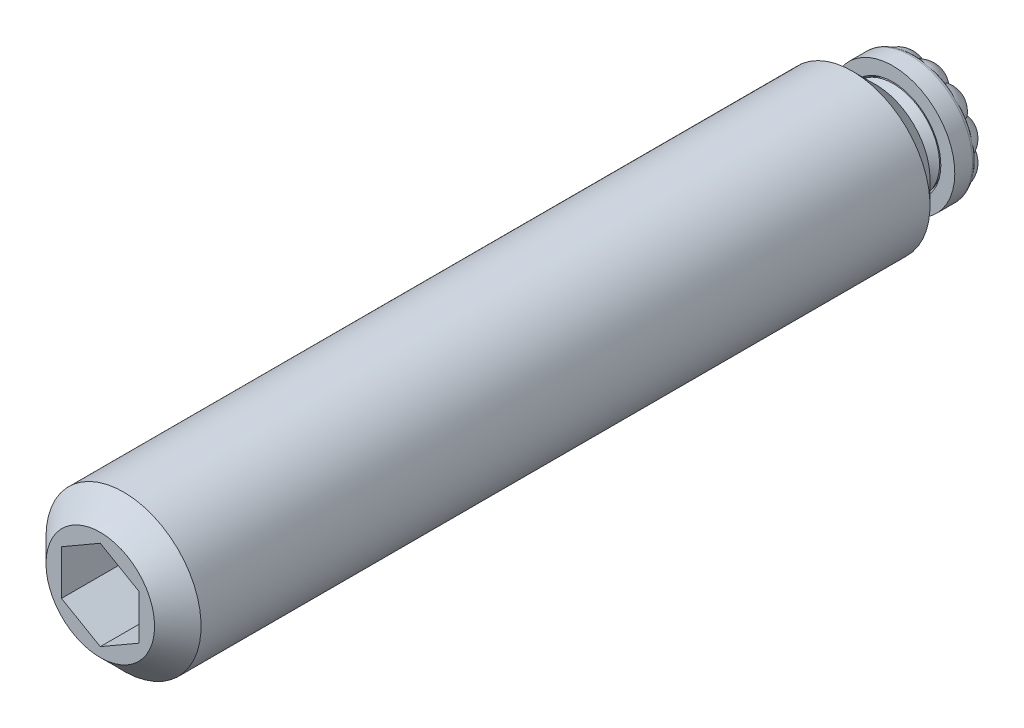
ISO-10303-21;
HEADER;
FILE_DESCRIPTION(('STEP AP214'),'2;1');
FILE_NAME('part.step','',(''),(''),'','','');
FILE_SCHEMA(('AUTOMOTIVE_DESIGN { 1 0 10303 214 1 1 1 1 }'));
ENDSEC;
DATA;
#1=APPLICATION_CONTEXT('core data for automotive mechanical design processes');
#2=APPLICATION_PROTOCOL_DEFINITION('international standard','automotive_design',2000,#1);
#3=PRODUCT_CONTEXT('',#1,'mechanical');
#4=PRODUCT('Part','Part','',(#3));
#5=PRODUCT_RELATED_PRODUCT_CATEGORY('part','',(#4));
#6=PRODUCT_DEFINITION_FORMATION('','',#4);
#7=PRODUCT_DEFINITION_CONTEXT('part definition',#1,'design');
#8=PRODUCT_DEFINITION('design','',#6,#7);
#9=PRODUCT_DEFINITION_SHAPE('','',#8);
#10=(LENGTH_UNIT() NAMED_UNIT(*) SI_UNIT(.MILLI.,.METRE.));
#11=(NAMED_UNIT(*) PLANE_ANGLE_UNIT() SI_UNIT($,.RADIAN.));
#12=(NAMED_UNIT(*) SI_UNIT($,.STERADIAN.) SOLID_ANGLE_UNIT());
#13=UNCERTAINTY_MEASURE_WITH_UNIT(LENGTH_MEASURE(1.E-05),#10,'distance_accuracy_value','');
#14=(GEOMETRIC_REPRESENTATION_CONTEXT(3) GLOBAL_UNCERTAINTY_ASSIGNED_CONTEXT((#13)) GLOBAL_UNIT_ASSIGNED_CONTEXT((#10,
#11,#12)) REPRESENTATION_CONTEXT('',''));
#15=CARTESIAN_POINT('',(0.,0.,0.));
#16=DIRECTION('',(0.,0.,1.));
#17=DIRECTION('',(1.,0.,0.));
#18=AXIS2_PLACEMENT_3D('',#15,#16,#17);
#19=CARTESIAN_POINT('',(0.,0.,1.99935993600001));
#20=DIRECTION('',(0.,0.,-1.));
#21=DIRECTION('',(-0.262070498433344,0.965048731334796,0.));
#22=AXIS2_PLACEMENT_3D('',#19,#20,#21);
#23=PLANE('',#22);
#24=CARTESIAN_POINT('',(0.,0.,1.99935993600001));
#25=DIRECTION('',(0.,0.,-1.));
#26=DIRECTION('',(-0.262070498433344,0.965048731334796,0.));
#27=AXIS2_PLACEMENT_3D('',#24,#25,#26);
#28=CIRCLE('',#27,2.8448);
#29=CARTESIAN_POINT('',(-0.745538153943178,2.74537063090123,1.99935993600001));
#30=VERTEX_POINT('',#29);
#31=EDGE_CURVE('E1002',#30,#30,#28,.T.);
#32=ORIENTED_EDGE('',*,*,#31,.F.);
#33=EDGE_LOOP('',(#32));
#34=FACE_BOUND('',#33,.T.);
#35=CARTESIAN_POINT('',(0.,0.,1.99935993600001));
#36=DIRECTION('',(0.,0.,1.));
#37=DIRECTION('',(0.,-1.,0.));
#38=AXIS2_PLACEMENT_3D('',#35,#36,#37);
#39=CIRCLE('',#38,2.619);
#40=CARTESIAN_POINT('',(0.,-2.619,1.99935993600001));
#41=VERTEX_POINT('',#40);
#42=EDGE_CURVE('E257',#41,#41,#39,.T.);
#43=ORIENTED_EDGE('',*,*,#42,.F.);
#44=EDGE_LOOP('',(#43));
#45=FACE_BOUND('',#44,.T.);
#46=ADVANCED_FACE('F14',(#34,#45),#23,.F.);
#47=CARTESIAN_POINT('',(0.,0.,0.999359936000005));
#48=DIRECTION('',(0.,0.,1.));
#49=DIRECTION('',(0.262070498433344,-0.965048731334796,0.));
#50=AXIS2_PLACEMENT_3D('',#47,#48,#49);
#51=PLANE('',#50);
#52=CARTESIAN_POINT('',(2.52423339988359,-0.667263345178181,0.999359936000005));
#53=DIRECTION('',(0.,0.,1.));
#54=DIRECTION('',(-0.255564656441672,-0.966791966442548,0.));
#55=AXIS2_PLACEMENT_3D('',#52,#53,#54);
#56=CIRCLE('',#55,1.33346353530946);
#57=CARTESIAN_POINT('',(3.67150451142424,0.0123644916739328,0.999359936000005));
#58=VERTEX_POINT('',#57);
#59=CARTESIAN_POINT('',(3.74381093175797,-0.128045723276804,0.999359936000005));
#60=VERTEX_POINT('',#59);
#61=EDGE_CURVE('E875',#58,#60,#56,.F.);
#62=ORIENTED_EDGE('',*,*,#61,.F.);
#63=CARTESIAN_POINT('',(2.51968192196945,0.684249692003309,0.999359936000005));
#64=DIRECTION('',(0.,0.,1.));
#65=DIRECTION('',(0.262070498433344,-0.965048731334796,0.));
#66=AXIS2_PLACEMENT_3D('',#63,#64,#65);
#67=CIRCLE('',#66,1.33346353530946);
#68=CARTESIAN_POINT('',(3.74286358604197,0.153258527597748,0.999359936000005));
#69=VERTEX_POINT('',#68);
#70=EDGE_CURVE('E996',#69,#58,#67,.F.);
#71=ORIENTED_EDGE('',*,*,#70,.F.);
#72=CARTESIAN_POINT('',(0.,0.,0.999359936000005));
#73=DIRECTION('',(0.,0.,-1.));
#74=DIRECTION('',(-0.262070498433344,0.965048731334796,0.));
#75=AXIS2_PLACEMENT_3D('',#72,#73,#74);
#76=CIRCLE('',#75,3.746);
#77=EDGE_CURVE('E450',#69,#60,#76,.T.);
#78=ORIENTED_EDGE('',*,*,#77,.T.);
#79=EDGE_LOOP('',(#62,#71,#78));
#80=FACE_BOUND('',#79,.T.);
#81=ADVANCED_FACE('F403',(#80),#51,.F.);
#82=CARTESIAN_POINT('',(3.31804421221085,-1.7387060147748,0.999359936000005));
#83=VERTEX_POINT('',#82);
#84=CARTESIAN_POINT('',(3.18579842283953,-1.82504429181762,0.999359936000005));
#85=VERTEX_POINT('',#84);
#86=EDGE_CURVE('E870',#83,#85,#56,.F.);
#87=ORIENTED_EDGE('',*,*,#86,.F.);
#88=CARTESIAN_POINT('',(3.17821251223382,-1.98279631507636,0.999359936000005));
#89=VERTEX_POINT('',#88);
#90=EDGE_CURVE('E872',#83,#89,#76,.T.);
#91=ORIENTED_EDGE('',*,*,#90,.T.);
#92=CARTESIAN_POINT('',(1.85241857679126,-1.83998370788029,0.999359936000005));
#93=DIRECTION('',(0.,0.,1.));
#94=DIRECTION('',(-0.704721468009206,-0.709484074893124,0.));
#95=AXIS2_PLACEMENT_3D('',#92,#93,#94);
#96=CIRCLE('',#95,1.33346353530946);
#97=EDGE_CURVE('E873',#85,#89,#96,.F.);
#98=ORIENTED_EDGE('',*,*,#97,.F.);
#99=EDGE_LOOP('',(#87,#91,#98));
#100=FACE_BOUND('',#99,.T.);
#101=ADVANCED_FACE('F409',(#100),#51,.F.);
#102=CARTESIAN_POINT('',(1.8399837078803,1.85241857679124,0.999359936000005));
#103=DIRECTION('',(0.,0.,1.));
#104=DIRECTION('',(0.709484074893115,-0.704721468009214,0.));
#105=AXIS2_PLACEMENT_3D('',#102,#103,#104);
#106=CIRCLE('',#105,1.33346353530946);
#107=CARTESIAN_POINT('',(3.16478568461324,2.00415757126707,0.999359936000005));
#108=VERTEX_POINT('',#107);
#109=CARTESIAN_POINT('',(3.17343393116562,1.84646021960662,0.999359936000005));
#110=VERTEX_POINT('',#109);
#111=EDGE_CURVE('E324',#108,#110,#106,.F.);
#112=ORIENTED_EDGE('',*,*,#111,.F.);
#113=CARTESIAN_POINT('',(3.30625823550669,1.76101461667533,0.999359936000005));
#114=VERTEX_POINT('',#113);
#115=EDGE_CURVE('E984',#108,#114,#76,.T.);
#116=ORIENTED_EDGE('',*,*,#115,.T.);
#117=EDGE_CURVE('E999',#110,#114,#67,.F.);
#118=ORIENTED_EDGE('',*,*,#117,.F.);
#119=EDGE_LOOP('',(#112,#116,#118));
#120=FACE_BOUND('',#119,.T.);
#121=ADVANCED_FACE('F684',(#120),#51,.F.);
#122=CARTESIAN_POINT('',(2.0041575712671,-3.16478568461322,0.999359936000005));
#123=VERTEX_POINT('',#122);
#124=CARTESIAN_POINT('',(1.84646021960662,-3.1734339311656,0.999359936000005));
#125=VERTEX_POINT('',#124);
#126=EDGE_CURVE('E888',#123,#125,#96,.F.);
#127=ORIENTED_EDGE('',*,*,#126,.F.);
#128=CARTESIAN_POINT('',(1.76101461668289,-3.30625823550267,0.999359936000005));
#129=VERTEX_POINT('',#128);
#130=EDGE_CURVE('E883',#123,#129,#76,.T.);
#131=ORIENTED_EDGE('',*,*,#130,.T.);
#132=CARTESIAN_POINT('',(0.684249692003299,-2.51968192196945,0.999359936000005));
#133=DIRECTION('',(0.,0.,1.));
#134=DIRECTION('',(-0.965048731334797,-0.26207049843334,0.));
#135=AXIS2_PLACEMENT_3D('',#132,#133,#134);
#136=CIRCLE('',#135,1.33346353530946);
#137=EDGE_CURVE('E916',#125,#129,#136,.F.);
#138=ORIENTED_EDGE('',*,*,#137,.F.);
#139=EDGE_LOOP('',(#127,#131,#138));
#140=FACE_BOUND('',#139,.T.);
#141=ADVANCED_FACE('F677',(#140),#51,.F.);
#142=CARTESIAN_POINT('',(0.153258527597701,-3.74286358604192,0.999359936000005));
#143=VERTEX_POINT('',#142);
#144=CARTESIAN_POINT('',(0.0123644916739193,-3.67150451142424,0.999359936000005));
#145=VERTEX_POINT('',#144);
#146=EDGE_CURVE('E918',#143,#145,#136,.F.);
#147=ORIENTED_EDGE('',*,*,#146,.F.);
#148=CARTESIAN_POINT('',(-0.128045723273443,-3.74381093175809,0.999359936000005));
#149=VERTEX_POINT('',#148);
#150=EDGE_CURVE('E953',#143,#149,#76,.T.);
#151=ORIENTED_EDGE('',*,*,#150,.T.);
#152=CARTESIAN_POINT('',(-0.667263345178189,-2.52423339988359,0.999359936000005));
#153=DIRECTION('',(0.,0.,1.));
#154=DIRECTION('',(-0.966791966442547,0.255564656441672,0.));
#155=AXIS2_PLACEMENT_3D('',#152,#153,#154);
#156=CIRCLE('',#155,1.33346353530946);
#157=EDGE_CURVE('E943',#145,#149,#156,.F.);
#158=ORIENTED_EDGE('',*,*,#157,.F.);
#159=EDGE_LOOP('',(#147,#151,#158));
#160=FACE_BOUND('',#159,.T.);
#161=ADVANCED_FACE('F670',(#160),#51,.F.);
#162=CARTESIAN_POINT('',(-1.73870601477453,-3.318044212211,0.999359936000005));
#163=VERTEX_POINT('',#162);
#164=CARTESIAN_POINT('',(-1.82504429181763,-3.18579842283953,0.999359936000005));
#165=VERTEX_POINT('',#164);
#166=EDGE_CURVE('E946',#163,#165,#156,.F.);
#167=ORIENTED_EDGE('',*,*,#166,.F.);
#168=CARTESIAN_POINT('',(-1.98279631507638,-3.17821251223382,0.999359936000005));
#169=VERTEX_POINT('',#168);
#170=EDGE_CURVE('E955',#163,#169,#76,.T.);
#171=ORIENTED_EDGE('',*,*,#170,.T.);
#172=CARTESIAN_POINT('',(-1.83998370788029,-1.85241857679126,0.999359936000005));
#173=DIRECTION('',(0.,0.,1.));
#174=DIRECTION('',(-0.709484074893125,0.704721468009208,0.));
#175=AXIS2_PLACEMENT_3D('',#172,#173,#174);
#176=CIRCLE('',#175,1.33346353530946);
#177=EDGE_CURVE('E1062',#165,#169,#176,.F.);
#178=ORIENTED_EDGE('',*,*,#177,.F.);
#179=EDGE_LOOP('',(#167,#171,#178));
#180=FACE_BOUND('',#179,.T.);
#181=ADVANCED_FACE('F663',(#180),#51,.F.);
#182=CARTESIAN_POINT('',(-3.16478568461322,-2.0041575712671,0.999359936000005));
#183=VERTEX_POINT('',#182);
#184=CARTESIAN_POINT('',(-3.17343393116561,-1.84646021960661,0.999359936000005));
#185=VERTEX_POINT('',#184);
#186=EDGE_CURVE('E1064',#183,#185,#176,.F.);
#187=ORIENTED_EDGE('',*,*,#186,.F.);
#188=CARTESIAN_POINT('',(-3.30625823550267,-1.76101461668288,0.999359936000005));
#189=VERTEX_POINT('',#188);
#190=EDGE_CURVE('E957',#183,#189,#76,.T.);
#191=ORIENTED_EDGE('',*,*,#190,.T.);
#192=CARTESIAN_POINT('',(-2.51968192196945,-0.684249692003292,0.999359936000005));
#193=DIRECTION('',(0.,0.,1.));
#194=DIRECTION('',(-0.262070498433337,0.965048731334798,0.));
#195=AXIS2_PLACEMENT_3D('',#192,#193,#194);
#196=CIRCLE('',#195,1.33346353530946);
#197=EDGE_CURVE('E1046',#185,#189,#196,.F.);
#198=ORIENTED_EDGE('',*,*,#197,.F.);
#199=EDGE_LOOP('',(#187,#191,#198));
#200=FACE_BOUND('',#199,.T.);
#201=ADVANCED_FACE('F656',(#200),#51,.F.);
#202=CARTESIAN_POINT('',(-3.74286358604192,-0.153258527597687,0.999359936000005));
#203=VERTEX_POINT('',#202);
#204=CARTESIAN_POINT('',(-3.67150451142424,-0.0123644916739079,0.999359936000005));
#205=VERTEX_POINT('',#204);
#206=EDGE_CURVE('E1047',#203,#205,#196,.F.);
#207=ORIENTED_EDGE('',*,*,#206,.F.);
#208=CARTESIAN_POINT('',(-3.74381093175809,0.128045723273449,0.999359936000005));
#209=VERTEX_POINT('',#208);
#210=EDGE_CURVE('E961',#203,#209,#76,.T.);
#211=ORIENTED_EDGE('',*,*,#210,.T.);
#212=CARTESIAN_POINT('',(-2.52423339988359,0.667263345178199,0.999359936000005));
#213=DIRECTION('',(0.,0.,1.));
#214=DIRECTION('',(0.25556465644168,0.966791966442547,0.));
#215=AXIS2_PLACEMENT_3D('',#212,#213,#214);
#216=CIRCLE('',#215,1.33346353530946);
#217=EDGE_CURVE('E1028',#205,#209,#216,.F.);
#218=ORIENTED_EDGE('',*,*,#217,.F.);
#219=EDGE_LOOP('',(#207,#211,#218));
#220=FACE_BOUND('',#219,.T.);
#221=ADVANCED_FACE('F649',(#220),#51,.F.);
#222=CARTESIAN_POINT('',(-3.31804421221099,1.73870601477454,0.999359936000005));
#223=VERTEX_POINT('',#222);
#224=CARTESIAN_POINT('',(-3.18579842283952,1.82504429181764,0.999359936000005));
#225=VERTEX_POINT('',#224);
#226=EDGE_CURVE('E1026',#223,#225,#216,.F.);
#227=ORIENTED_EDGE('',*,*,#226,.F.);
#228=CARTESIAN_POINT('',(-3.17821251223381,1.98279631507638,0.999359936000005));
#229=VERTEX_POINT('',#228);
#230=EDGE_CURVE('E966',#223,#229,#76,.T.);
#231=ORIENTED_EDGE('',*,*,#230,.T.);
#232=CARTESIAN_POINT('',(-1.85241857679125,1.8399837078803,0.999359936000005));
#233=DIRECTION('',(0.,0.,1.));
#234=DIRECTION('',(0.704721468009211,0.709484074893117,0.));
#235=AXIS2_PLACEMENT_3D('',#232,#233,#234);
#236=CIRCLE('',#235,1.33346353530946);
#237=EDGE_CURVE('E486',#225,#229,#236,.F.);
#238=ORIENTED_EDGE('',*,*,#237,.F.);
#239=EDGE_LOOP('',(#227,#231,#238));
#240=FACE_BOUND('',#239,.T.);
#241=ADVANCED_FACE('F642',(#240),#51,.F.);
#242=CARTESIAN_POINT('',(-2.00415757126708,3.16478568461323,0.999359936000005));
#243=VERTEX_POINT('',#242);
#244=CARTESIAN_POINT('',(-1.8464602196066,3.17343393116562,0.999359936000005));
#245=VERTEX_POINT('',#244);
#246=EDGE_CURVE('E498',#243,#245,#236,.F.);
#247=ORIENTED_EDGE('',*,*,#246,.F.);
#248=CARTESIAN_POINT('',(-1.76101461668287,3.30625823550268,0.999359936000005));
#249=VERTEX_POINT('',#248);
#250=EDGE_CURVE('E971',#243,#249,#76,.T.);
#251=ORIENTED_EDGE('',*,*,#250,.T.);
#252=CARTESIAN_POINT('',(-0.684249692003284,2.51968192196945,0.999359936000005));
#253=DIRECTION('',(0.,0.,1.));
#254=DIRECTION('',(0.965048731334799,0.262070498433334,0.));
#255=AXIS2_PLACEMENT_3D('',#252,#253,#254);
#256=CIRCLE('',#255,1.33346353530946);
#257=EDGE_CURVE('E488',#245,#249,#256,.F.);
#258=ORIENTED_EDGE('',*,*,#257,.F.);
#259=EDGE_LOOP('',(#247,#251,#258));
#260=FACE_BOUND('',#259,.T.);
#261=ADVANCED_FACE('F635',(#260),#51,.F.);
#262=CARTESIAN_POINT('',(1.82504429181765,3.18579842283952,0.999359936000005));
#263=VERTEX_POINT('',#262);
#264=CARTESIAN_POINT('',(1.98279631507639,3.1782125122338,0.999359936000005));
#265=VERTEX_POINT('',#264);
#266=EDGE_CURVE('E323',#263,#265,#106,.F.);
#267=ORIENTED_EDGE('',*,*,#266,.F.);
#268=CARTESIAN_POINT('',(0.667263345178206,2.52423339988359,0.999359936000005));
#269=DIRECTION('',(0.,0.,1.));
#270=DIRECTION('',(0.966791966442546,-0.255564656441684,0.));
#271=AXIS2_PLACEMENT_3D('',#268,#269,#270);
#272=CIRCLE('',#271,1.33346353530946);
#273=CARTESIAN_POINT('',(1.73870601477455,3.31804421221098,0.999359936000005));
#274=VERTEX_POINT('',#273);
#275=EDGE_CURVE('E519',#274,#263,#272,.F.);
#276=ORIENTED_EDGE('',*,*,#275,.F.);
#277=EDGE_CURVE('E981',#274,#265,#76,.T.);
#278=ORIENTED_EDGE('',*,*,#277,.T.);
#279=EDGE_LOOP('',(#267,#276,#278));
#280=FACE_BOUND('',#279,.T.);
#281=ADVANCED_FACE('F628',(#280),#51,.F.);
#282=CARTESIAN_POINT('',(-0.153258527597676,3.74286358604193,0.999359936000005));
#283=VERTEX_POINT('',#282);
#284=CARTESIAN_POINT('',(-0.0123644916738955,3.67150451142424,0.999359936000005));
#285=VERTEX_POINT('',#284);
#286=EDGE_CURVE('E482',#283,#285,#256,.F.);
#287=ORIENTED_EDGE('',*,*,#286,.F.);
#288=CARTESIAN_POINT('',(0.128045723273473,3.74381093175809,0.999359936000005));
#289=VERTEX_POINT('',#288);
#290=EDGE_CURVE('E976',#283,#289,#76,.T.);
#291=ORIENTED_EDGE('',*,*,#290,.T.);
#292=EDGE_CURVE('E520',#285,#289,#272,.F.);
#293=ORIENTED_EDGE('',*,*,#292,.F.);
#294=EDGE_LOOP('',(#287,#291,#293));
#295=FACE_BOUND('',#294,.T.);
#296=ADVANCED_FACE('F412',(#295),#51,.F.);
#297=CARTESIAN_POINT('',(0.,0.,1.25335993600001));
#298=DIRECTION('',(0.,0.,-1.));
#299=DIRECTION('',(-0.262070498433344,0.965048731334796,0.));
#300=AXIS2_PLACEMENT_3D('',#297,#298,#299);
#301=TOROIDAL_SURFACE('',#300,3.746,0.254);
#302=CARTESIAN_POINT('',(0.,0.,1.25335993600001));
#303=DIRECTION('',(0.,0.,-1.));
#304=DIRECTION('',(-0.262070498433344,0.965048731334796,0.));
#305=AXIS2_PLACEMENT_3D('',#302,#303,#304);
#306=CIRCLE('',#305,4.);
#307=CARTESIAN_POINT('',(-1.04828199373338,3.86019492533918,1.25335993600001));
#308=VERTEX_POINT('',#307);
#309=EDGE_CURVE('E988',#308,#308,#306,.T.);
#310=ORIENTED_EDGE('',*,*,#309,.T.);
#311=EDGE_LOOP('',(#310));
#312=FACE_BOUND('',#311,.T.);
#313=CARTESIAN_POINT('',(3.47583491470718,0.335613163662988,1.25355993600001));
#314=CARTESIAN_POINT('',(3.47596996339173,0.333979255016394,1.24235210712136));
#315=CARTESIAN_POINT('',(3.47697038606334,0.331362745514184,1.23138401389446));
#316=CARTESIAN_POINT('',(3.48035366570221,0.324570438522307,1.21033094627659));
#317=CARTESIAN_POINT('',(3.48271661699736,0.320417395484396,1.20023561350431));
#318=CARTESIAN_POINT('',(3.48847480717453,0.310930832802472,1.18107880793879));
#319=CARTESIAN_POINT('',(3.49186122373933,0.305607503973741,1.1720093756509));
#320=CARTESIAN_POINT('',(3.49939926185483,0.294029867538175,1.15479039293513));
#321=CARTESIAN_POINT('',(3.5035539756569,0.287771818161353,1.14664478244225));
#322=CARTESIAN_POINT('',(3.51584452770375,0.269398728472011,1.12526229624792));
#323=CARTESIAN_POINT('',(3.52455699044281,0.25652407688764,1.11301283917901));
#324=CARTESIAN_POINT('',(3.54280922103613,0.22935360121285,1.09098682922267));
#325=CARTESIAN_POINT('',(3.5523508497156,0.215054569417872,1.08121604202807));
#326=CARTESIAN_POINT('',(3.57887694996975,0.174619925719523,1.05733295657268));
#327=CARTESIAN_POINT('',(3.59619252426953,0.147487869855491,1.04528484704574));
#328=CARTESIAN_POINT('',(3.63042684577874,0.0913995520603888,1.02587031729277));
#329=CARTESIAN_POINT('',(3.64734456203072,0.062439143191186,1.01851499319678));
#330=CARTESIAN_POINT('',(3.69064129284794,-0.015854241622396,1.00394827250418));
#331=CARTESIAN_POINT('',(3.71609324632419,-0.0662910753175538,0.99988300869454));
#332=CARTESIAN_POINT('',(3.76234030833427,-0.16918579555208,0.998932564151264));
#333=CARTESIAN_POINT('',(3.78313385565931,-0.221644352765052,1.00204978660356));
#334=CARTESIAN_POINT('',(3.82496231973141,-0.344751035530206,1.01547854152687));
#335=CARTESIAN_POINT('',(3.84397865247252,-0.415887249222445,1.02775966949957));
#336=CARTESIAN_POINT('',(3.8643961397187,-0.523363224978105,1.05054161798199));
#337=CARTESIAN_POINT('',(3.86985652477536,-0.559473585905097,1.05890766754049));
#338=CARTESIAN_POINT('',(3.87789558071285,-0.631775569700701,1.07660351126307));
#339=CARTESIAN_POINT('',(3.88047575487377,-0.667967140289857,1.08593279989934));
#340=CARTESIAN_POINT('',(3.88225864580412,-0.729190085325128,1.10189599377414));
#341=CARTESIAN_POINT('',(3.8822582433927,-0.75421683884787,1.10847268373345));
#342=CARTESIAN_POINT('',(3.88071043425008,-0.80429694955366,1.12130011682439));
#343=CARTESIAN_POINT('',(3.87916394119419,-0.829350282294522,1.12755105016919));
#344=CARTESIAN_POINT('',(3.8744158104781,-0.879074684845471,1.13885994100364));
#345=CARTESIAN_POINT('',(3.87124661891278,-0.903743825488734,1.14393855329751));
#346=CARTESIAN_POINT('',(3.86302516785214,-0.953104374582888,1.15164718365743));
#347=CARTESIAN_POINT('',(3.85798123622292,-0.977795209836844,1.15428785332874));
#348=CARTESIAN_POINT('',(3.8467761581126,-1.02315858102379,1.15566534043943));
#349=CARTESIAN_POINT('',(3.84089339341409,-1.0438817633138,1.15492513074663));
#350=CARTESIAN_POINT('',(3.82782370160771,-1.08471351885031,1.1510461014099));
#351=CARTESIAN_POINT('',(3.8206330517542,-1.10482014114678,1.14790035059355));
#352=CARTESIAN_POINT('',(3.8050336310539,-1.14463406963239,1.14014287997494));
#353=CARTESIAN_POINT('',(3.79660663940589,-1.16432922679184,1.13550771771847));
#354=CARTESIAN_POINT('',(3.77874605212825,-1.20305602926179,1.12555678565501));
#355=CARTESIAN_POINT('',(3.76931300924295,-1.22208803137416,1.12024138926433));
#356=CARTESIAN_POINT('',(3.74180980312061,-1.27412886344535,1.10518120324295));
#357=CARTESIAN_POINT('',(3.72271414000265,-1.30653203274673,1.09519781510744));
#358=CARTESIAN_POINT('',(3.68175166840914,-1.36971846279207,1.0758216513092));
#359=CARTESIAN_POINT('',(3.65988346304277,-1.40050089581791,1.06642917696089));
#360=CARTESIAN_POINT('',(3.59066786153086,-1.49003153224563,1.04026713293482));
#361=CARTESIAN_POINT('',(3.53944866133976,-1.5464450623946,1.02534906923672));
#362=CARTESIAN_POINT('',(3.44216195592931,-1.63932861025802,1.00707556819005));
#363=CARTESIAN_POINT('',(3.39787399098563,-1.67731109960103,1.00178979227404));
#364=CARTESIAN_POINT('',(3.30559300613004,-1.74898484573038,0.998231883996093));
#365=CARTESIAN_POINT('',(3.25760351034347,-1.78268010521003,0.999953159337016));
#366=CARTESIAN_POINT('',(3.18173260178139,-1.83138390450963,1.010184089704));
#367=CARTESIAN_POINT('',(3.15442850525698,-1.84802437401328,1.01532386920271));
#368=CARTESIAN_POINT('',(3.09985378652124,-1.87979236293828,1.02929816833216));
#369=CARTESIAN_POINT('',(3.07258315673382,-1.89492126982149,1.03812926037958));
#370=CARTESIAN_POINT('',(3.02709713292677,-1.91921654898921,1.05713685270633));
#371=CARTESIAN_POINT('',(3.00861473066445,-1.92881212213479,1.06611929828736));
#372=CARTESIAN_POINT('',(2.97277947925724,-1.94706279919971,1.08688733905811));
#373=CARTESIAN_POINT('',(2.95542428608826,-1.95571988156,1.09866686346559));
#374=CARTESIAN_POINT('',(2.92947834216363,-1.96861649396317,1.12021651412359));
#375=CARTESIAN_POINT('',(2.9201686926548,-1.97323298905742,1.12889117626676));
#376=CARTESIAN_POINT('',(2.90273913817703,-1.98195697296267,1.14761018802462));
#377=CARTESIAN_POINT('',(2.89461833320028,-1.9860648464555,1.15765349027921));
#378=CARTESIAN_POINT('',(2.88181861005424,-1.99274352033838,1.17667351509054));
#379=CARTESIAN_POINT('',(2.87677825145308,-1.99544983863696,1.18535729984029));
#380=CARTESIAN_POINT('',(2.86808622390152,-2.00036995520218,1.20350842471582));
#381=CARTESIAN_POINT('',(2.86442971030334,-2.00258546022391,1.21297288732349));
#382=CARTESIAN_POINT('',(2.86021356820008,-2.00547864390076,1.22773684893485));
#383=CARTESIAN_POINT('',(2.85901350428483,-2.00637908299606,1.23281421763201));
#384=CARTESIAN_POINT('',(2.85710355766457,-2.00801009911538,1.24310097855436));
#385=CARTESIAN_POINT('',(2.85639499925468,-2.00874021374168,1.24831068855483));
#386=CARTESIAN_POINT('',(2.85595329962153,-2.00937684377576,1.25355993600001));
#387=B_SPLINE_CURVE_WITH_KNOTS('',3,(#313,#314,#315,#316,#317,#318,#319,#320,#321,#322,#323,
#324,#325,#326,#327,#328,#329,#330,#331,#332,#333,#334,#335,#336,#337,#338,#339,#340,#341,#342,
#343,#344,#345,#346,#347,#348,#349,#350,#351,#352,#353,#354,#355,#356,#357,#358,#359,#360,#361,
#362,#363,#364,#365,#366,#367,#368,#369,#370,#371,#372,#373,#374,#375,#376,#377,#378,#379,#380,
#381,#382,#383,#384,#385,#386),.UNSPECIFIED.,.F.,.F.,(4,2,2,2,2,2,2,2,2,2,2,2,2,2,2,2,2,2,2,2,2,
2,2,2,2,2,2,2,2,2,2,2,2,2,2,2,4),(0.,0.0337831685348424,0.0670848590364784,0.100107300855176,
0.133265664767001,0.192299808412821,0.25147003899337,0.353992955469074,0.456757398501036,
0.625733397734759,0.794765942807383,1.01745457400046,1.1297656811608,1.24201814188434,
1.31960951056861,1.39715505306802,1.47320732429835,1.54892572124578,1.61336391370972,
1.67798847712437,1.74368458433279,1.80934478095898,1.92591955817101,2.04255330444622,
2.27412506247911,2.4493433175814,2.62439676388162,2.7213791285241,2.81827163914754,
2.88616012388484,2.95390258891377,2.99441599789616,3.03489857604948,3.06599129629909,
3.0969741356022,3.11283290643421,3.12873424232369),.UNSPECIFIED.);
#388=EDGE_CURVE('E878',#60,#83,#387,.T.);
#389=ORIENTED_EDGE('',*,*,#388,.F.);
#390=ORIENTED_EDGE('',*,*,#77,.F.);
#391=CARTESIAN_POINT('',(2.84235475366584,2.0285669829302,1.25355993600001));
#392=CARTESIAN_POINT('',(2.8432886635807,2.02721950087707,1.24235210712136));
#393=CARTESIAN_POINT('',(2.84546330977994,2.02545374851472,1.23138401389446));
#394=CARTESIAN_POINT('',(2.85178946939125,2.02126307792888,1.21033094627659));
#395=CARTESIAN_POINT('',(2.85591236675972,2.01884791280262,1.20023561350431));
#396=CARTESIAN_POINT('',(2.86564238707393,2.01351140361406,1.18107880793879));
#397=CARTESIAN_POINT('',(2.8712367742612,2.01059447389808,1.1720093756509));
#398=CARTESIAN_POINT('',(2.88355372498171,2.00433696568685,1.15479039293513));
#399=CARTESIAN_POINT('',(2.89028083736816,2.00099469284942,1.14664478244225));
#400=CARTESIAN_POINT('',(2.91011131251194,1.99122840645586,1.12526229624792));
#401=CARTESIAN_POINT('',(2.92409385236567,1.98443486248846,1.11301283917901));
#402=CARTESIAN_POINT('',(2.95348598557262,1.97003065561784,1.09098682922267));
#403=CARTESIAN_POINT('',(2.96889879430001,1.96241814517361,1.08121604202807));
#404=CARTESIAN_POINT('',(3.01208839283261,1.94066376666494,1.05733295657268));
#405=CARTESIAN_POINT('',(3.04065014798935,1.92582450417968,1.04528484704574));
#406=CARTESIAN_POINT('',(3.0983420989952,1.89436775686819,1.02587031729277));
#407=CARTESIAN_POINT('',(3.12747347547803,1.87774616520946,1.01851499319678));
#408=CARTESIAN_POINT('',(3.20411623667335,1.83159047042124,1.00394827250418));
#409=CARTESIAN_POINT('',(3.2513766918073,1.80063686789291,0.99988300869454));
#410=CARTESIAN_POINT('',(3.34287518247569,1.73465095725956,0.998932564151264));
#411=CARTESIAN_POINT('',(3.38711220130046,1.69961728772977,1.00204978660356));
#412=CARTESIAN_POINT('',(3.48489005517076,1.61391800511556,1.01547854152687));
#413=CARTESIAN_POINT('',(3.5369267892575,1.5618204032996,1.02775966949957));
#414=CARTESIAN_POINT('',(3.60834683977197,1.47895222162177,1.05054161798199));
#415=CARTESIAN_POINT('',(3.63113085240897,1.4504099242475,1.05890766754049));
#416=CARTESIAN_POINT('',(3.67424387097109,1.39181409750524,1.07660351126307));
#417=CARTESIAN_POINT('',(3.69457415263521,1.36176136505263,1.08593279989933));
#418=CARTESIAN_POINT('',(3.7267296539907,1.30963218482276,1.10189599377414));
#419=CARTESIAN_POINT('',(3.73924268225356,1.28795817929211,1.10847268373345));
#420=CARTESIAN_POINT('',(3.76294229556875,1.24381362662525,1.1213001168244));
#421=CARTESIAN_POINT('',(3.774129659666,1.22134355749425,1.12755105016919));
#422=CARTESIAN_POINT('',(3.79487985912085,1.17590689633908,1.13885994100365));
#423=CARTESIAN_POINT('',(3.80446982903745,1.15295819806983,1.14393855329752));
#424=CARTESIAN_POINT('',(3.82203011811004,1.10609998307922,1.15164718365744));
#425=CARTESIAN_POINT('',(3.83000736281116,1.08219512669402,1.15428785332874));
#426=CARTESIAN_POINT('',(3.84298516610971,1.03730675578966,1.15566534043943));
#427=CARTESIAN_POINT('',(3.84825213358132,1.01641857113,1.15492513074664));
#428=CARTESIAN_POINT('',(3.85734932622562,0.974522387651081,1.15104610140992));
#429=CARTESIAN_POINT('',(3.861175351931,0.953514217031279,1.14790035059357));
#430=CARTESIAN_POINT('',(3.86757282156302,0.911234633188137,1.14014287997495));
#431=CARTESIAN_POINT('',(3.87012241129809,0.889964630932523,1.13550771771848));
#432=CARTESIAN_POINT('',(3.87401809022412,0.847495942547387,1.12555678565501));
#433=CARTESIAN_POINT('',(3.87536483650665,0.826297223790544,1.12024138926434));
#434=CARTESIAN_POINT('',(3.87756677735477,0.767476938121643,1.10518120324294));
#435=CARTESIAN_POINT('',(3.87723103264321,0.729867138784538,1.09519781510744));
#436=CARTESIAN_POINT('',(3.87334970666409,0.654664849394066,1.0758216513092));
#437=CARTESIAN_POINT('',(3.86980250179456,0.617072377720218,1.06642917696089));
#438=CARTESIAN_POINT('',(3.85462535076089,0.50492877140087,1.04026713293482));
#439=CARTESIAN_POINT('',(3.83847498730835,0.43046362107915,1.02534906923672));
#440=CARTESIAN_POINT('',(3.80066400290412,0.301380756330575,1.00707556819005));
#441=CARTESIAN_POINT('',(3.78130074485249,0.246342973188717,1.00178979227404));
#442=CARTESIAN_POINT('',(3.73721994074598,0.138131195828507,0.998231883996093));
#443=CARTESIAN_POINT('',(3.71250744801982,0.0849554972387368,0.999953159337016));
#444=CARTESIAN_POINT('',(3.67115321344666,0.00484131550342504,1.010184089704));
#445=CARTESIAN_POINT('',(3.65582740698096,-0.0232218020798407,1.01532386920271));
#446=CARTESIAN_POINT('',(3.62444830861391,-0.078021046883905,1.02929816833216));
#447=CARTESIAN_POINT('',(3.60839570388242,-0.104758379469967,1.03812926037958));
#448=CARTESIAN_POINT('',(3.58115129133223,-0.148541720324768,1.05713685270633));
#449=CARTESIAN_POINT('',(3.56994284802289,-0.166092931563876,1.06611929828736));
#450=CARTESIAN_POINT('',(3.5480339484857,-0.199816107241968,1.08688733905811));
#451=CARTESIAN_POINT('',(3.53733245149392,-0.215990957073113,1.0986668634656));
#452=CARTESIAN_POINT('',(3.5213109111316,-0.24013272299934,1.12021651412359));
#453=CARTESIAN_POINT('',(3.51555676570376,-0.248785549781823,1.12889117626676));
#454=CARTESIAN_POINT('',(3.50482432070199,-0.265055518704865,1.14761018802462));
#455=CARTESIAN_POINT('',(3.49984543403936,-0.272673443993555,1.15765349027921));
#456=CARTESIAN_POINT('',(3.49209988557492,-0.284857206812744,1.17667351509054));
#457=CARTESIAN_POINT('',(3.48908796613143,-0.289721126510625,1.1853572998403));
#458=CARTESIAN_POINT('',(3.48402050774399,-0.298328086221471,1.20350842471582));
#459=CARTESIAN_POINT('',(3.48196162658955,-0.30207502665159,1.21297288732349));
#460=CARTESIAN_POINT('',(3.47975693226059,-0.306688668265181,1.22773684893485));
#461=CARTESIAN_POINT('',(3.47916786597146,-0.308068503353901,1.23281421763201));
#462=CARTESIAN_POINT('',(3.47832931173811,-0.31043597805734,1.24310097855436));
#463=CARTESIAN_POINT('',(3.47808073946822,-0.311422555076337,1.24831068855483));
#464=CARTESIAN_POINT('',(3.47801653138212,-0.312194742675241,1.25355993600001));
#465=B_SPLINE_CURVE_WITH_KNOTS('',3,(#391,#392,#393,#394,#395,#396,#397,#398,#399,#400,#401,
#402,#403,#404,#405,#406,#407,#408,#409,#410,#411,#412,#413,#414,#415,#416,#417,#418,#419,#420,
#421,#422,#423,#424,#425,#426,#427,#428,#429,#430,#431,#432,#433,#434,#435,#436,#437,#438,#439,
#440,#441,#442,#443,#444,#445,#446,#447,#448,#449,#450,#451,#452,#453,#454,#455,#456,#457,#458,
#459,#460,#461,#462,#463,#464),.UNSPECIFIED.,.F.,.F.,(4,2,2,2,2,2,2,2,2,2,2,2,2,2,2,2,2,2,2,2,2,
2,2,2,2,2,2,2,2,2,2,2,2,2,2,2,4),(0.,0.0337831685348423,0.0670848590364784,0.100107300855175,
0.133265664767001,0.192299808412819,0.251470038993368,0.353992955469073,0.456757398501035,
0.62573339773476,0.794765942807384,1.01745457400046,1.1297656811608,1.24201814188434,
1.31960951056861,1.39715505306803,1.47320732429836,1.54892572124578,1.61336391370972,
1.67798847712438,1.74368458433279,1.80934478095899,1.92591955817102,2.04255330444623,
2.27412506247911,2.44934331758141,2.62439676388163,2.72137912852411,2.81827163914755,
2.88616012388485,2.95390258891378,2.99441599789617,3.03489857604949,3.0659912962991,
3.09697413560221,3.11283290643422,3.1287342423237),.UNSPECIFIED.);
#466=EDGE_CURVE('E441',#114,#69,#465,.T.);
#467=ORIENTED_EDGE('',*,*,#466,.F.);
#468=ORIENTED_EDGE('',*,*,#115,.F.);
#469=CARTESIAN_POINT('',(1.44726793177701,3.17796791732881,1.25355993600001));
#470=CARTESIAN_POINT('',(1.4487504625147,3.17726791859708,1.24235210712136));
#471=CARTESIAN_POINT('',(1.45151663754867,3.17682605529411,1.23138401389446));
#472=CARTESIAN_POINT('',(1.45909058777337,3.17635990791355,1.21033094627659));
#473=CARTESIAN_POINT('',(1.46386870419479,3.1763297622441,1.20023561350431));
#474=CARTESIAN_POINT('',(1.47496340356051,3.17657321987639,1.18107880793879));
#475=CARTESIAN_POINT('',(1.48126674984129,3.17684427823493,1.1720093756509));
#476=CARTESIAN_POINT('',(1.49506229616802,3.17758359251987,1.15479039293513));
#477=CARTESIAN_POINT('',(1.50255928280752,3.17805265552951,1.14664478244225));
#478=CARTESIAN_POINT('',(1.52461612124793,3.17951004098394,1.12526229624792));
#479=CARTESIAN_POINT('',(1.54012212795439,3.1806179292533,1.11301283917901));
#480=CARTESIAN_POINT('',(1.57277856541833,3.18283958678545,1.09098682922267));
#481=CARTESIAN_POINT('',(1.58993270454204,3.18395336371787,1.08121604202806));
#482=CARTESIAN_POINT('',(1.63821318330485,3.18670831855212,1.05733295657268));
#483=CARTESIAN_POINT('',(1.67036802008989,3.18813801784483,1.04528484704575));
#484=CARTESIAN_POINT('',(1.73605908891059,3.18974165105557,1.02587031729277));
#485=CARTESIAN_POINT('',(1.76959839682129,3.1899126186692,1.01851499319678));
#486=CARTESIAN_POINT('',(1.85905082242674,3.18826199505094,1.00394827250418));
#487=CARTESIAN_POINT('',(1.91545637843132,3.18508561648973,0.99988300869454));
#488=CARTESIAN_POINT('',(2.02768935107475,3.17368938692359,0.998932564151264));
#489=CARTESIAN_POINT('',(2.08351656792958,3.16546784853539,1.00204978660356));
#490=CARTESIAN_POINT('',(2.21104431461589,3.14013901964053,1.01547854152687));
#491=CARTESIAN_POINT('',(2.28215824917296,3.12103954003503,1.02775966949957));
#492=CARTESIAN_POINT('',(2.38544391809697,3.08498361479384,1.05054161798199));
#493=CARTESIAN_POINT('',(2.4194466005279,3.07165726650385,1.05890766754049));
#494=CARTESIAN_POINT('',(2.48608148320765,3.04246830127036,1.07660351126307));
#495=CARTESIAN_POINT('',(2.51871438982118,3.02660701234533,1.08593279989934));
#496=CARTESIAN_POINT('',(2.57262646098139,2.99753956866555,1.10189599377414));
#497=CARTESIAN_POINT('',(2.59430006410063,2.98502584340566,1.10847268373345));
#498=CARTESIAN_POINT('',(2.63689680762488,2.95864534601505,1.12130011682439));
#499=CARTESIAN_POINT('',(2.65782038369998,2.94477937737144,1.12755105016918));
#500=CARTESIAN_POINT('',(2.69850891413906,2.91580517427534,1.13885994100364));
#501=CARTESIAN_POINT('',(2.718288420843,2.90072600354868,1.1439385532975));
#502=CARTESIAN_POINT('',(2.75692518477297,2.86892574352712,1.15164718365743));
#503=CARTESIAN_POINT('',(2.77578610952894,2.85221215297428,1.15428785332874));
#504=CARTESIAN_POINT('',(2.80946940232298,2.81982658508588,1.15566534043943));
#505=CARTESIAN_POINT('',(2.82447482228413,2.80437037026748,1.15492513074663));
#506=CARTESIAN_POINT('',(2.85330131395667,2.77263580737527,1.1510461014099));
#507=CARTESIAN_POINT('',(2.86711883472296,2.75635521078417,1.14790035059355));
#508=CARTESIAN_POINT('',(2.8937989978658,2.72293875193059,1.14014287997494));
#509=CARTESIAN_POINT('',(2.90664200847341,2.70579318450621,1.13550771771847));
#510=CARTESIAN_POINT('',(2.9312501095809,2.67096206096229,1.125556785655));
#511=CARTESIAN_POINT('',(2.94301578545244,2.65327680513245,1.12024138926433));
#512=CARTESIAN_POINT('',(2.974332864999,2.60343791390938,1.10518120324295));
#513=CARTESIAN_POINT('',(2.99284700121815,2.57069899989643,1.09519781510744));
#514=CARTESIAN_POINT('',(3.0270868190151,2.50363124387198,1.07582165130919));
#515=CARTESIAN_POINT('',(3.04281108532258,2.46930160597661,1.06642917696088));
#516=CARTESIAN_POINT('',(3.08573909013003,2.36459381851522,1.04026713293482));
#517=CARTESIAN_POINT('',(3.10898504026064,2.29202992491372,1.02534906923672));
#518=CARTESIAN_POINT('',(3.14078119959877,2.16133539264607,1.00707556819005));
#519=CARTESIAN_POINT('',(3.15153101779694,2.10398964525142,1.00178979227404));
#520=CARTESIAN_POINT('',(3.16746181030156,1.98823509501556,0.998231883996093));
#521=CARTESIAN_POINT('',(3.17264801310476,1.92982734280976,0.999953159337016));
#522=CARTESIAN_POINT('',(3.17689128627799,1.83976930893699,1.010184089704));
#523=CARTESIAN_POINT('',(3.17765030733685,1.80780303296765,1.01532386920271));
#524=CARTESIAN_POINT('',(3.17787483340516,1.7446559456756,1.02929816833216));
#525=CARTESIAN_POINT('',(3.17734153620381,1.71347443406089,1.03812926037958));
#526=CARTESIAN_POINT('',(3.17563885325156,1.66193474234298,1.05713685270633));
#527=CARTESIAN_POINT('',(3.17470766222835,1.64113072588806,1.06611929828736));
#528=CARTESIAN_POINT('',(3.17259558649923,1.60097114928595,1.08688733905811));
#529=CARTESIAN_POINT('',(3.1714152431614,1.58161256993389,1.09866686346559));
#530=CARTESIAN_POINT('',(3.16961106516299,1.5526944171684,1.12021651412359));
#531=CARTESIAN_POINT('',(3.16895424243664,1.54232377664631,1.12889117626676));
#532=CARTESIAN_POINT('',(3.16779465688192,1.52286734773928,1.14761018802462));
#533=CARTESIAN_POINT('',(3.16729177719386,1.51378058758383,1.15765349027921));
#534=CARTESIAN_POINT('',(3.16667581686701,1.49935636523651,1.17667351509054));
#535=CARTESIAN_POINT('',(3.16649937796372,1.49363812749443,1.1853572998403));
#536=CARTESIAN_POINT('',(3.166414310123,1.48365055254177,1.20350842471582));
#537=CARTESIAN_POINT('',(3.16650473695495,1.47937616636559,1.21297288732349));
#538=CARTESIAN_POINT('',(3.16690223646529,1.47427828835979,1.22773684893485));
#539=CARTESIAN_POINT('',(3.16708200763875,1.47278878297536,1.23281421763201));
#540=CARTESIAN_POINT('',(3.16753953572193,1.47031921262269,1.24310097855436));
#541=CARTESIAN_POINT('',(3.16781755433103,1.46934052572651,1.24831068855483));
#542=CARTESIAN_POINT('',(3.16814804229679,1.46863968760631,1.25355993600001));
#543=B_SPLINE_CURVE_WITH_KNOTS('',3,(#469,#470,#471,#472,#473,#474,#475,#476,#477,#478,#479,
#480,#481,#482,#483,#484,#485,#486,#487,#488,#489,#490,#491,#492,#493,#494,#495,#496,#497,#498,
#499,#500,#501,#502,#503,#504,#505,#506,#507,#508,#509,#510,#511,#512,#513,#514,#515,#516,#517,
#518,#519,#520,#521,#522,#523,#524,#525,#526,#527,#528,#529,#530,#531,#532,#533,#534,#535,#536,
#537,#538,#539,#540,#541,#542),.UNSPECIFIED.,.F.,.F.,(4,2,2,2,2,2,2,2,2,2,2,2,2,2,2,2,2,2,2,2,2,
2,2,2,2,2,2,2,2,2,2,2,2,2,2,2,4),(0.,0.0337831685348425,0.0670848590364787,0.100107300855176,
0.133265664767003,0.192299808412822,0.25147003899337,0.353992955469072,0.456757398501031,
0.625733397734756,0.79476594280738,1.01745457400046,1.1297656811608,1.24201814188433,
1.31960951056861,1.39715505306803,1.47320732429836,1.54892572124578,1.61336391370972,
1.67798847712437,1.74368458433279,1.80934478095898,1.92591955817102,2.04255330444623,
2.27412506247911,2.4493433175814,2.62439676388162,2.72137912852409,2.81827163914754,
2.88616012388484,2.95390258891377,2.99441599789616,3.03489857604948,3.06599129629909,
3.0969741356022,3.11283290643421,3.12873424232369),.UNSPECIFIED.);
#544=EDGE_CURVE('E314',#265,#108,#543,.T.);
#545=ORIENTED_EDGE('',*,*,#544,.F.);
#546=ORIENTED_EDGE('',*,*,#277,.F.);
#547=CARTESIAN_POINT('',(-0.335613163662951,3.47583491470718,1.25355993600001));
#548=CARTESIAN_POINT('',(-0.333979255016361,3.47596996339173,1.24235210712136));
#549=CARTESIAN_POINT('',(-0.331362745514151,3.47697038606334,1.23138401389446));
#550=CARTESIAN_POINT('',(-0.324570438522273,3.48035366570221,1.21033094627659));
#551=CARTESIAN_POINT('',(-0.32041739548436,3.48271661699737,1.20023561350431));
#552=CARTESIAN_POINT('',(-0.310930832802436,3.48847480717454,1.18107880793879));
#553=CARTESIAN_POINT('',(-0.305607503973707,3.49186122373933,1.1720093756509));
#554=CARTESIAN_POINT('',(-0.294029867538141,3.49939926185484,1.15479039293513));
#555=CARTESIAN_POINT('',(-0.287771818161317,3.5035539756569,1.14664478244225));
#556=CARTESIAN_POINT('',(-0.269398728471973,3.51584452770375,1.12526229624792));
#557=CARTESIAN_POINT('',(-0.256524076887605,3.52455699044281,1.11301283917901));
#558=CARTESIAN_POINT('',(-0.229353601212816,3.54280922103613,1.09098682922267));
#559=CARTESIAN_POINT('',(-0.215054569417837,3.55235084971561,1.08121604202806));
#560=CARTESIAN_POINT('',(-0.174619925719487,3.57887694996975,1.05733295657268));
#561=CARTESIAN_POINT('',(-0.147487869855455,3.59619252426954,1.04528484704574));
#562=CARTESIAN_POINT('',(-0.0913995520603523,3.63042684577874,1.02587031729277));
#563=CARTESIAN_POINT('',(-0.062439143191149,3.64734456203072,1.01851499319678));
#564=CARTESIAN_POINT('',(0.0158542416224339,3.69064129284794,1.00394827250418));
#565=CARTESIAN_POINT('',(0.0662910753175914,3.71609324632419,0.99988300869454));
#566=CARTESIAN_POINT('',(0.169185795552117,3.76234030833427,0.998932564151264));
#567=CARTESIAN_POINT('',(0.221644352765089,3.78313385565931,1.00204978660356));
#568=CARTESIAN_POINT('',(0.344751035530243,3.82496231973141,1.01547854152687));
#569=CARTESIAN_POINT('',(0.415887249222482,3.84397865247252,1.02775966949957));
#570=CARTESIAN_POINT('',(0.523363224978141,3.8643961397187,1.05054161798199));
#571=CARTESIAN_POINT('',(0.559473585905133,3.86985652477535,1.05890766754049));
#572=CARTESIAN_POINT('',(0.631775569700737,3.87789558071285,1.07660351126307));
#573=CARTESIAN_POINT('',(0.667967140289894,3.88047575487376,1.08593279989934));
#574=CARTESIAN_POINT('',(0.729190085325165,3.88225864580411,1.10189599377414));
#575=CARTESIAN_POINT('',(0.754216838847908,3.88225824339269,1.10847268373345));
#576=CARTESIAN_POINT('',(0.804296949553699,3.88071043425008,1.1213001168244));
#577=CARTESIAN_POINT('',(0.829350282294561,3.87916394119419,1.12755105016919));
#578=CARTESIAN_POINT('',(0.879074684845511,3.87441581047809,1.13885994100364));
#579=CARTESIAN_POINT('',(0.903743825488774,3.87124661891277,1.14393855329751));
#580=CARTESIAN_POINT('',(0.953104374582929,3.86302516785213,1.15164718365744));
#581=CARTESIAN_POINT('',(0.977795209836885,3.85798123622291,1.15428785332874));
#582=CARTESIAN_POINT('',(1.02315858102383,3.84677615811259,1.15566534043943));
#583=CARTESIAN_POINT('',(1.04388176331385,3.84089339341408,1.15492513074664));
#584=CARTESIAN_POINT('',(1.08471351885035,3.8278237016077,1.15104610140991));
#585=CARTESIAN_POINT('',(1.10482014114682,3.82063305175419,1.14790035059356));
#586=CARTESIAN_POINT('',(1.14463406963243,3.80503363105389,1.14014287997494));
#587=CARTESIAN_POINT('',(1.16432922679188,3.79660663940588,1.13550771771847));
#588=CARTESIAN_POINT('',(1.20305602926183,3.77874605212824,1.12555678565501));
#589=CARTESIAN_POINT('',(1.2220880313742,3.76931300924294,1.12024138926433));
#590=CARTESIAN_POINT('',(1.27412886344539,3.74180980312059,1.10518120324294));
#591=CARTESIAN_POINT('',(1.30653203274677,3.72271414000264,1.09519781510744));
#592=CARTESIAN_POINT('',(1.36971846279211,3.68175166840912,1.0758216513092));
#593=CARTESIAN_POINT('',(1.40050089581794,3.65988346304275,1.06642917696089));
#594=CARTESIAN_POINT('',(1.49003153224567,3.59066786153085,1.04026713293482));
#595=CARTESIAN_POINT('',(1.54644506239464,3.53944866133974,1.02534906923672));
#596=CARTESIAN_POINT('',(1.63932861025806,3.44216195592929,1.00707556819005));
#597=CARTESIAN_POINT('',(1.67731109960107,3.39787399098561,1.00178979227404));
#598=CARTESIAN_POINT('',(1.74898484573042,3.30559300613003,0.998231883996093));
#599=CARTESIAN_POINT('',(1.78268010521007,3.25760351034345,0.999953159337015));
#600=CARTESIAN_POINT('',(1.83138390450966,3.18173260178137,1.010184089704));
#601=CARTESIAN_POINT('',(1.84802437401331,3.15442850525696,1.01532386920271));
#602=CARTESIAN_POINT('',(1.87979236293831,3.09985378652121,1.02929816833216));
#603=CARTESIAN_POINT('',(1.89492126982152,3.0725831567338,1.03812926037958));
#604=CARTESIAN_POINT('',(1.91921654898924,3.02709713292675,1.05713685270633));
#605=CARTESIAN_POINT('',(1.92881212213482,3.00861473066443,1.06611929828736));
#606=CARTESIAN_POINT('',(1.94706279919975,2.97277947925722,1.08688733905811));
#607=CARTESIAN_POINT('',(1.95571988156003,2.95542428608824,1.09866686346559));
#608=CARTESIAN_POINT('',(1.9686164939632,2.92947834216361,1.12021651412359));
#609=CARTESIAN_POINT('',(1.97323298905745,2.92016869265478,1.12889117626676));
#610=CARTESIAN_POINT('',(1.9819569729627,2.90273913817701,1.14761018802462));
#611=CARTESIAN_POINT('',(1.98606484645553,2.89461833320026,1.1576534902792));
#612=CARTESIAN_POINT('',(1.99274352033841,2.88181861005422,1.17667351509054));
#613=CARTESIAN_POINT('',(1.99544983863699,2.87677825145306,1.1853572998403));
#614=CARTESIAN_POINT('',(2.00036995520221,2.86808622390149,1.20350842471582));
#615=CARTESIAN_POINT('',(2.00258546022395,2.86442971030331,1.21297288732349));
#616=CARTESIAN_POINT('',(2.00547864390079,2.86021356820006,1.22773684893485));
#617=CARTESIAN_POINT('',(2.00637908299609,2.85901350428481,1.23281421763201));
#618=CARTESIAN_POINT('',(2.00801009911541,2.85710355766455,1.24310097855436));
#619=CARTESIAN_POINT('',(2.00874021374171,2.85639499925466,1.24831068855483));
#620=CARTESIAN_POINT('',(2.00937684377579,2.85595329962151,1.25355993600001));
#621=B_SPLINE_CURVE_WITH_KNOTS('',3,(#547,#548,#549,#550,#551,#552,#553,#554,#555,#556,#557,
#558,#559,#560,#561,#562,#563,#564,#565,#566,#567,#568,#569,#570,#571,#572,#573,#574,#575,#576,
#577,#578,#579,#580,#581,#582,#583,#584,#585,#586,#587,#588,#589,#590,#591,#592,#593,#594,#595,
#596,#597,#598,#599,#600,#601,#602,#603,#604,#605,#606,#607,#608,#609,#610,#611,#612,#613,#614,
#615,#616,#617,#618,#619,#620),.UNSPECIFIED.,.F.,.F.,(4,2,2,2,2,2,2,2,2,2,2,2,2,2,2,2,2,2,2,2,2,
2,2,2,2,2,2,2,2,2,2,2,2,2,2,2,4),(0.,0.0337831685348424,0.0670848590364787,0.100107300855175,
0.133265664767,0.192299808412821,0.25147003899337,0.353992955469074,0.456757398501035,
0.62573339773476,0.794765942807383,1.01745457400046,1.1297656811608,1.24201814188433,
1.31960951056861,1.39715505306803,1.47320732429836,1.54892572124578,1.61336391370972,
1.67798847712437,1.74368458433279,1.80934478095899,1.92591955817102,2.04255330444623,
2.27412506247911,2.44934331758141,2.62439676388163,2.7213791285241,2.81827163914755,
2.88616012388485,2.95390258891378,2.99441599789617,3.03489857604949,3.0659912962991,
3.09697413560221,3.11283290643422,3.12873424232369),.UNSPECIFIED.);
#622=EDGE_CURVE('E521',#289,#274,#621,.T.);
#623=ORIENTED_EDGE('',*,*,#622,.F.);
#624=ORIENTED_EDGE('',*,*,#290,.F.);
#625=CARTESIAN_POINT('',(-2.02856698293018,2.84235475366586,1.25355993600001));
#626=CARTESIAN_POINT('',(-2.02721950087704,2.84328866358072,1.24235210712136));
#627=CARTESIAN_POINT('',(-2.02545374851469,2.84546330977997,1.23138401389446));
#628=CARTESIAN_POINT('',(-2.02126307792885,2.85178946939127,1.21033094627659));
#629=CARTESIAN_POINT('',(-2.01884791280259,2.85591236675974,1.20023561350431));
#630=CARTESIAN_POINT('',(-2.01351140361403,2.86564238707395,1.18107880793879));
#631=CARTESIAN_POINT('',(-2.01059447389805,2.87123677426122,1.1720093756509));
#632=CARTESIAN_POINT('',(-2.00433696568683,2.88355372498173,1.15479039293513));
#633=CARTESIAN_POINT('',(-2.0009946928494,2.89028083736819,1.14664478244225));
#634=CARTESIAN_POINT('',(-1.99122840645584,2.91011131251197,1.12526229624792));
#635=CARTESIAN_POINT('',(-1.98443486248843,2.9240938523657,1.113012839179));
#636=CARTESIAN_POINT('',(-1.97003065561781,2.95348598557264,1.09098682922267));
#637=CARTESIAN_POINT('',(-1.96241814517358,2.96889879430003,1.08121604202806));
#638=CARTESIAN_POINT('',(-1.94066376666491,3.01208839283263,1.05733295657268));
#639=CARTESIAN_POINT('',(-1.92582450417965,3.04065014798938,1.04528484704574));
#640=CARTESIAN_POINT('',(-1.89436775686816,3.09834209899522,1.02587031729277));
#641=CARTESIAN_POINT('',(-1.87774616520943,3.12747347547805,1.01851499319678));
#642=CARTESIAN_POINT('',(-1.83159047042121,3.20411623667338,1.00394827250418));
#643=CARTESIAN_POINT('',(-1.80063686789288,3.25137669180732,0.99988300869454));
#644=CARTESIAN_POINT('',(-1.73465095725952,3.34287518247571,0.998932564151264));
#645=CARTESIAN_POINT('',(-1.69961728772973,3.38711220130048,1.00204978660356));
#646=CARTESIAN_POINT('',(-1.61391800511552,3.48489005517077,1.01547854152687));
#647=CARTESIAN_POINT('',(-1.56182040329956,3.53692678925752,1.02775966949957));
#648=CARTESIAN_POINT('',(-1.47895222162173,3.60834683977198,1.05054161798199));
#649=CARTESIAN_POINT('',(-1.45040992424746,3.63113085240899,1.05890766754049));
#650=CARTESIAN_POINT('',(-1.3918140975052,3.6742438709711,1.07660351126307));
#651=CARTESIAN_POINT('',(-1.36176136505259,3.69457415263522,1.08593279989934));
#652=CARTESIAN_POINT('',(-1.30963218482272,3.72672965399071,1.10189599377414));
#653=CARTESIAN_POINT('',(-1.28795817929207,3.73924268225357,1.10847268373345));
#654=CARTESIAN_POINT('',(-1.24381362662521,3.76294229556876,1.12130011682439));
#655=CARTESIAN_POINT('',(-1.22134355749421,3.77412965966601,1.12755105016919));
#656=CARTESIAN_POINT('',(-1.17590689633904,3.79487985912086,1.13885994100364));
#657=CARTESIAN_POINT('',(-1.15295819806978,3.80446982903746,1.14393855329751));
#658=CARTESIAN_POINT('',(-1.10609998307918,3.82203011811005,1.15164718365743));
#659=CARTESIAN_POINT('',(-1.08219512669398,3.83000736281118,1.15428785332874));
#660=CARTESIAN_POINT('',(-1.03730675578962,3.84298516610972,1.15566534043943));
#661=CARTESIAN_POINT('',(-1.01641857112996,3.84825213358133,1.15492513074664));
#662=CARTESIAN_POINT('',(-0.974522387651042,3.85734932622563,1.15104610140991));
#663=CARTESIAN_POINT('',(-0.95351421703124,3.861175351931,1.14790035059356));
#664=CARTESIAN_POINT('',(-0.911234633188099,3.86757282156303,1.14014287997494));
#665=CARTESIAN_POINT('',(-0.889964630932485,3.8701224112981,1.13550771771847));
#666=CARTESIAN_POINT('',(-0.847495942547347,3.87401809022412,1.12555678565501));
#667=CARTESIAN_POINT('',(-0.826297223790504,3.87536483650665,1.12024138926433));
#668=CARTESIAN_POINT('',(-0.767476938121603,3.87756677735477,1.10518120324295));
#669=CARTESIAN_POINT('',(-0.729867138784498,3.87723103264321,1.09519781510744));
#670=CARTESIAN_POINT('',(-0.654664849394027,3.8733497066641,1.0758216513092));
#671=CARTESIAN_POINT('',(-0.617072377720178,3.86980250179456,1.06642917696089));
#672=CARTESIAN_POINT('',(-0.50492877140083,3.85462535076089,1.04026713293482));
#673=CARTESIAN_POINT('',(-0.43046362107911,3.83847498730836,1.02534906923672));
#674=CARTESIAN_POINT('',(-0.301380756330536,3.80066400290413,1.00707556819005));
#675=CARTESIAN_POINT('',(-0.246342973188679,3.78130074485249,1.00178979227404));
#676=CARTESIAN_POINT('',(-0.13813119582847,3.73721994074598,0.998231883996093));
#677=CARTESIAN_POINT('',(-0.0849554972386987,3.71250744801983,0.999953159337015));
#678=CARTESIAN_POINT('',(-0.00484131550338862,3.67115321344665,1.010184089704));
#679=CARTESIAN_POINT('',(0.0232218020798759,3.65582740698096,1.01532386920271));
#680=CARTESIAN_POINT('',(0.0780210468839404,3.62444830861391,1.02929816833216));
#681=CARTESIAN_POINT('',(0.104758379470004,3.60839570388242,1.03812926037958));
#682=CARTESIAN_POINT('',(0.148541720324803,3.58115129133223,1.05713685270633));
#683=CARTESIAN_POINT('',(0.16609293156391,3.56994284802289,1.06611929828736));
#684=CARTESIAN_POINT('',(0.199816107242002,3.5480339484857,1.08688733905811));
#685=CARTESIAN_POINT('',(0.21599095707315,3.53733245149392,1.09866686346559));
#686=CARTESIAN_POINT('',(0.240132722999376,3.5213109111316,1.12021651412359));
#687=CARTESIAN_POINT('',(0.248785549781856,3.51555676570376,1.12889117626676));
#688=CARTESIAN_POINT('',(0.265055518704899,3.50482432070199,1.14761018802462));
#689=CARTESIAN_POINT('',(0.272673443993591,3.49984543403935,1.15765349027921));
#690=CARTESIAN_POINT('',(0.28485720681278,3.49209988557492,1.17667351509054));
#691=CARTESIAN_POINT('',(0.289721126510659,3.48908796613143,1.1853572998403));
#692=CARTESIAN_POINT('',(0.298328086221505,3.48402050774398,1.20350842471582));
#693=CARTESIAN_POINT('',(0.302075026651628,3.48196162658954,1.21297288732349));
#694=CARTESIAN_POINT('',(0.306688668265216,3.47975693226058,1.22773684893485));
#695=CARTESIAN_POINT('',(0.308068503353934,3.47916786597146,1.23281421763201));
#696=CARTESIAN_POINT('',(0.310435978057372,3.47832931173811,1.24310097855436));
#697=CARTESIAN_POINT('',(0.311422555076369,3.47808073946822,1.24831068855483));
#698=CARTESIAN_POINT('',(0.312194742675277,3.47801653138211,1.25355993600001));
#699=B_SPLINE_CURVE_WITH_KNOTS('',3,(#625,#626,#627,#628,#629,#630,#631,#632,#633,#634,#635,
#636,#637,#638,#639,#640,#641,#642,#643,#644,#645,#646,#647,#648,#649,#650,#651,#652,#653,#654,
#655,#656,#657,#658,#659,#660,#661,#662,#663,#664,#665,#666,#667,#668,#669,#670,#671,#672,#673,
#674,#675,#676,#677,#678,#679,#680,#681,#682,#683,#684,#685,#686,#687,#688,#689,#690,#691,#692,
#693,#694,#695,#696,#697,#698),.UNSPECIFIED.,.F.,.F.,(4,2,2,2,2,2,2,2,2,2,2,2,2,2,2,2,2,2,2,2,2,
2,2,2,2,2,2,2,2,2,2,2,2,2,2,2,4),(0.,0.0337831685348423,0.067084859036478,0.100107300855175,
0.133265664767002,0.192299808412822,0.251470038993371,0.353992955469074,0.456757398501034,
0.625733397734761,0.794765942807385,1.01745457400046,1.1297656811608,1.24201814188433,
1.31960951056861,1.39715505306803,1.47320732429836,1.54892572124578,1.61336391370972,
1.67798847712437,1.74368458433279,1.80934478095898,1.92591955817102,2.04255330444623,
2.27412506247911,2.4493433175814,2.62439676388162,2.7213791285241,2.81827163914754,
2.88616012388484,2.95390258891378,2.99441599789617,3.03489857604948,3.0659912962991,
3.09697413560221,3.11283290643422,3.12873424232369),.UNSPECIFIED.);
#700=EDGE_CURVE('E512',#249,#283,#699,.T.);
#701=ORIENTED_EDGE('',*,*,#700,.F.);
#702=ORIENTED_EDGE('',*,*,#250,.F.);
#703=CARTESIAN_POINT('',(-3.17796791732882,1.447267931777,1.25355993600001));
#704=CARTESIAN_POINT('',(-3.17726791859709,1.44875046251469,1.24235210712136));
#705=CARTESIAN_POINT('',(-3.17682605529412,1.45151663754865,1.23138401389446));
#706=CARTESIAN_POINT('',(-3.17635990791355,1.45909058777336,1.21033094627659));
#707=CARTESIAN_POINT('',(-3.1763297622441,1.46386870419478,1.20023561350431));
#708=CARTESIAN_POINT('',(-3.17657321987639,1.4749634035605,1.18107880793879));
#709=CARTESIAN_POINT('',(-3.17684427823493,1.48126674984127,1.1720093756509));
#710=CARTESIAN_POINT('',(-3.17758359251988,1.49506229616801,1.15479039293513));
#711=CARTESIAN_POINT('',(-3.17805265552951,1.50255928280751,1.14664478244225));
#712=CARTESIAN_POINT('',(-3.17951004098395,1.52461612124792,1.12526229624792));
#713=CARTESIAN_POINT('',(-3.18061792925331,1.54012212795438,1.113012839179));
#714=CARTESIAN_POINT('',(-3.18283958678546,1.57277856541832,1.09098682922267));
#715=CARTESIAN_POINT('',(-3.18395336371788,1.58993270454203,1.08121604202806));
#716=CARTESIAN_POINT('',(-3.18670831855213,1.63821318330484,1.05733295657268));
#717=CARTESIAN_POINT('',(-3.18813801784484,1.67036802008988,1.04528484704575));
#718=CARTESIAN_POINT('',(-3.18974165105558,1.73605908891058,1.02587031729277));
#719=CARTESIAN_POINT('',(-3.18991261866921,1.76959839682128,1.01851499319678));
#720=CARTESIAN_POINT('',(-3.18826199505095,1.85905082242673,1.00394827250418));
#721=CARTESIAN_POINT('',(-3.18508561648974,1.91545637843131,0.99988300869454));
#722=CARTESIAN_POINT('',(-3.1736893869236,2.02768935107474,0.998932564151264));
#723=CARTESIAN_POINT('',(-3.1654678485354,2.08351656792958,1.00204978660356));
#724=CARTESIAN_POINT('',(-3.14013901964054,2.21104431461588,1.01547854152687));
#725=CARTESIAN_POINT('',(-3.12103954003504,2.28215824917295,1.02775966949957));
#726=CARTESIAN_POINT('',(-3.08498361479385,2.38544391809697,1.05054161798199));
#727=CARTESIAN_POINT('',(-3.07165726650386,2.41944660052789,1.05890766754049));
#728=CARTESIAN_POINT('',(-3.04246830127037,2.48608148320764,1.07660351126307));
#729=CARTESIAN_POINT('',(-3.02660701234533,2.51871438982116,1.08593279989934));
#730=CARTESIAN_POINT('',(-2.99753956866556,2.57262646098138,1.10189599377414));
#731=CARTESIAN_POINT('',(-2.98502584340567,2.59430006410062,1.10847268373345));
#732=CARTESIAN_POINT('',(-2.95864534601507,2.63689680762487,1.1213001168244));
#733=CARTESIAN_POINT('',(-2.94477937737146,2.65782038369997,1.12755105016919));
#734=CARTESIAN_POINT('',(-2.91580517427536,2.69850891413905,1.13885994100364));
#735=CARTESIAN_POINT('',(-2.9007260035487,2.71828842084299,1.14393855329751));
#736=CARTESIAN_POINT('',(-2.86892574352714,2.75692518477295,1.15164718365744));
#737=CARTESIAN_POINT('',(-2.8522121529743,2.77578610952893,1.15428785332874));
#738=CARTESIAN_POINT('',(-2.8198265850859,2.80946940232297,1.15566534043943));
#739=CARTESIAN_POINT('',(-2.8043703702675,2.82447482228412,1.15492513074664));
#740=CARTESIAN_POINT('',(-2.77263580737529,2.85330131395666,1.15104610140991));
#741=CARTESIAN_POINT('',(-2.75635521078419,2.86711883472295,1.14790035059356));
#742=CARTESIAN_POINT('',(-2.72293875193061,2.89379899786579,1.14014287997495));
#743=CARTESIAN_POINT('',(-2.70579318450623,2.9066420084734,1.13550771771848));
#744=CARTESIAN_POINT('',(-2.67096206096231,2.93125010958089,1.12555678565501));
#745=CARTESIAN_POINT('',(-2.65327680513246,2.94301578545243,1.12024138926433));
#746=CARTESIAN_POINT('',(-2.60343791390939,2.97433286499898,1.10518120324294));
#747=CARTESIAN_POINT('',(-2.57069899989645,2.99284700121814,1.09519781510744));
#748=CARTESIAN_POINT('',(-2.50363124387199,3.0270868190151,1.0758216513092));
#749=CARTESIAN_POINT('',(-2.46930160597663,3.04281108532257,1.06642917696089));
#750=CARTESIAN_POINT('',(-2.36459381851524,3.08573909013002,1.04026713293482));
#751=CARTESIAN_POINT('',(-2.29202992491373,3.10898504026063,1.02534906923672));
#752=CARTESIAN_POINT('',(-2.16133539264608,3.14078119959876,1.00707556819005));
#753=CARTESIAN_POINT('',(-2.10398964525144,3.15153101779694,1.00178979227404));
#754=CARTESIAN_POINT('',(-1.98823509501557,3.16746181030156,0.998231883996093));
#755=CARTESIAN_POINT('',(-1.92982734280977,3.17264801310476,0.999953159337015));
#756=CARTESIAN_POINT('',(-1.839769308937,3.17689128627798,1.010184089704));
#757=CARTESIAN_POINT('',(-1.80780303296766,3.17765030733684,1.01532386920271));
#758=CARTESIAN_POINT('',(-1.74465594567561,3.17787483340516,1.02929816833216));
#759=CARTESIAN_POINT('',(-1.7134744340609,3.1773415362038,1.03812926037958));
#760=CARTESIAN_POINT('',(-1.66193474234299,3.17563885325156,1.05713685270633));
#761=CARTESIAN_POINT('',(-1.64113072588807,3.17470766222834,1.06611929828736));
#762=CARTESIAN_POINT('',(-1.60097114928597,3.17259558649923,1.08688733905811));
#763=CARTESIAN_POINT('',(-1.5816125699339,3.1714152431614,1.0986668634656));
#764=CARTESIAN_POINT('',(-1.55269441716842,3.16961106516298,1.12021651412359));
#765=CARTESIAN_POINT('',(-1.54232377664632,3.16895424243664,1.12889117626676));
#766=CARTESIAN_POINT('',(-1.5228673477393,3.16779465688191,1.14761018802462));
#767=CARTESIAN_POINT('',(-1.51378058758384,3.16729177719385,1.15765349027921));
#768=CARTESIAN_POINT('',(-1.49935636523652,3.166675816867,1.17667351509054));
#769=CARTESIAN_POINT('',(-1.49363812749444,3.16649937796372,1.1853572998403));
#770=CARTESIAN_POINT('',(-1.48365055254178,3.166414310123,1.20350842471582));
#771=CARTESIAN_POINT('',(-1.4793761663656,3.16650473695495,1.21297288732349));
#772=CARTESIAN_POINT('',(-1.4742782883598,3.16690223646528,1.22773684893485));
#773=CARTESIAN_POINT('',(-1.47278878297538,3.16708200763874,1.23281421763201));
#774=CARTESIAN_POINT('',(-1.4703192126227,3.16753953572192,1.24310097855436));
#775=CARTESIAN_POINT('',(-1.46934052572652,3.16781755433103,1.24831068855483));
#776=CARTESIAN_POINT('',(-1.46863968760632,3.16814804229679,1.25355993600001));
#777=B_SPLINE_CURVE_WITH_KNOTS('',3,(#703,#704,#705,#706,#707,#708,#709,#710,#711,#712,#713,
#714,#715,#716,#717,#718,#719,#720,#721,#722,#723,#724,#725,#726,#727,#728,#729,#730,#731,#732,
#733,#734,#735,#736,#737,#738,#739,#740,#741,#742,#743,#744,#745,#746,#747,#748,#749,#750,#751,
#752,#753,#754,#755,#756,#757,#758,#759,#760,#761,#762,#763,#764,#765,#766,#767,#768,#769,#770,
#771,#772,#773,#774,#775,#776),.UNSPECIFIED.,.F.,.F.,(4,2,2,2,2,2,2,2,2,2,2,2,2,2,2,2,2,2,2,2,2,
2,2,2,2,2,2,2,2,2,2,2,2,2,2,2,4),(0.,0.0337831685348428,0.0670848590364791,0.100107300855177,
0.133265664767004,0.192299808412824,0.251470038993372,0.353992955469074,0.456757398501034,
0.625733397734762,0.794765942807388,1.01745457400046,1.1297656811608,1.24201814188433,
1.31960951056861,1.39715505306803,1.47320732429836,1.54892572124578,1.61336391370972,
1.67798847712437,1.74368458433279,1.80934478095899,1.92591955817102,2.04255330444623,
2.27412506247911,2.44934331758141,2.62439676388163,2.7213791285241,2.81827163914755,
2.88616012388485,2.95390258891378,2.99441599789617,3.03489857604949,3.0659912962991,
3.09697413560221,3.11283290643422,3.12873424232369),.UNSPECIFIED.);
#778=EDGE_CURVE('E483',#229,#243,#777,.T.);
#779=ORIENTED_EDGE('',*,*,#778,.F.);
#780=ORIENTED_EDGE('',*,*,#230,.F.);
#781=CARTESIAN_POINT('',(-3.47583491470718,-0.335613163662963,1.25355993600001));
#782=CARTESIAN_POINT('',(-3.47596996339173,-0.333979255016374,1.24235210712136));
#783=CARTESIAN_POINT('',(-3.47697038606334,-0.331362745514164,1.23138401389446));
#784=CARTESIAN_POINT('',(-3.48035366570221,-0.324570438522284,1.21033094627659));
#785=CARTESIAN_POINT('',(-3.48271661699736,-0.32041739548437,1.20023561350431));
#786=CARTESIAN_POINT('',(-3.48847480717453,-0.310930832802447,1.18107880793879));
#787=CARTESIAN_POINT('',(-3.49186122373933,-0.305607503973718,1.1720093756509));
#788=CARTESIAN_POINT('',(-3.49939926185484,-0.294029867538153,1.15479039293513));
#789=CARTESIAN_POINT('',(-3.50355397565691,-0.287771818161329,1.14664478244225));
#790=CARTESIAN_POINT('',(-3.51584452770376,-0.269398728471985,1.12526229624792));
#791=CARTESIAN_POINT('',(-3.52455699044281,-0.256524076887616,1.113012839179));
#792=CARTESIAN_POINT('',(-3.54280922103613,-0.229353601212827,1.09098682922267));
#793=CARTESIAN_POINT('',(-3.55235084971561,-0.215054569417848,1.08121604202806));
#794=CARTESIAN_POINT('',(-3.57887694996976,-0.174619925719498,1.05733295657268));
#795=CARTESIAN_POINT('',(-3.59619252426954,-0.147487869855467,1.04528484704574));
#796=CARTESIAN_POINT('',(-3.63042684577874,-0.0913995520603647,1.02587031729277));
#797=CARTESIAN_POINT('',(-3.64734456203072,-0.0624391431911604,1.01851499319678));
#798=CARTESIAN_POINT('',(-3.69064129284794,0.0158542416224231,1.00394827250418));
#799=CARTESIAN_POINT('',(-3.71609324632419,0.066291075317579,0.99988300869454));
#800=CARTESIAN_POINT('',(-3.76234030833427,0.169185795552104,0.998932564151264));
#801=CARTESIAN_POINT('',(-3.78313385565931,0.221644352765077,1.00204978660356));
#802=CARTESIAN_POINT('',(-3.8249623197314,0.344751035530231,1.01547854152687));
#803=CARTESIAN_POINT('',(-3.84397865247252,0.415887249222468,1.02775966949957));
#804=CARTESIAN_POINT('',(-3.86439613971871,0.523363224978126,1.05054161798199));
#805=CARTESIAN_POINT('',(-3.86985652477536,0.559473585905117,1.05890766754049));
#806=CARTESIAN_POINT('',(-3.87789558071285,0.631775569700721,1.07660351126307));
#807=CARTESIAN_POINT('',(-3.88047575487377,0.667967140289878,1.08593279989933));
#808=CARTESIAN_POINT('',(-3.88225864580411,0.729190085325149,1.10189599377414));
#809=CARTESIAN_POINT('',(-3.88225824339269,0.754216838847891,1.10847268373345));
#810=CARTESIAN_POINT('',(-3.88071043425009,0.804296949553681,1.1213001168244));
#811=CARTESIAN_POINT('',(-3.87916394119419,0.829350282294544,1.12755105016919));
#812=CARTESIAN_POINT('',(-3.8744158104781,0.879074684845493,1.13885994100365));
#813=CARTESIAN_POINT('',(-3.87124661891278,0.903743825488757,1.14393855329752));
#814=CARTESIAN_POINT('',(-3.86302516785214,0.953104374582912,1.15164718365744));
#815=CARTESIAN_POINT('',(-3.85798123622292,0.977795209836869,1.15428785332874));
#816=CARTESIAN_POINT('',(-3.8467761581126,1.02315858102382,1.15566534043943));
#817=CARTESIAN_POINT('',(-3.84089339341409,1.04388176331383,1.15492513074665));
#818=CARTESIAN_POINT('',(-3.82782370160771,1.08471351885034,1.15104610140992));
#819=CARTESIAN_POINT('',(-3.8206330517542,1.10482014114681,1.14790035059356));
#820=CARTESIAN_POINT('',(-3.8050336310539,1.14463406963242,1.14014287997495));
#821=CARTESIAN_POINT('',(-3.79660663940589,1.16432922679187,1.13550771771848));
#822=CARTESIAN_POINT('',(-3.77874605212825,1.20305602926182,1.12555678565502));
#823=CARTESIAN_POINT('',(-3.76931300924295,1.22208803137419,1.12024138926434));
#824=CARTESIAN_POINT('',(-3.7418098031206,1.27412886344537,1.10518120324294));
#825=CARTESIAN_POINT('',(-3.72271414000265,1.30653203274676,1.09519781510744));
#826=CARTESIAN_POINT('',(-3.68175166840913,1.3697184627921,1.0758216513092));
#827=CARTESIAN_POINT('',(-3.65988346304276,1.40050089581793,1.06642917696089));
#828=CARTESIAN_POINT('',(-3.59066786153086,1.49003153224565,1.04026713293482));
#829=CARTESIAN_POINT('',(-3.53944866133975,1.54644506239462,1.02534906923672));
#830=CARTESIAN_POINT('',(-3.4421619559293,1.63932861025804,1.00707556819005));
#831=CARTESIAN_POINT('',(-3.39787399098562,1.67731109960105,1.00178979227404));
#832=CARTESIAN_POINT('',(-3.30559300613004,1.74898484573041,0.998231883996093));
#833=CARTESIAN_POINT('',(-3.25760351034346,1.78268010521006,0.999953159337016));
#834=CARTESIAN_POINT('',(-3.18173260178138,1.83138390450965,1.010184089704));
#835=CARTESIAN_POINT('',(-3.15442850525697,1.8480243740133,1.01532386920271));
#836=CARTESIAN_POINT('',(-3.09985378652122,1.8797923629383,1.02929816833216));
#837=CARTESIAN_POINT('',(-3.0725831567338,1.89492126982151,1.03812926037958));
#838=CARTESIAN_POINT('',(-3.02709713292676,1.91921654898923,1.05713685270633));
#839=CARTESIAN_POINT('',(-3.00861473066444,1.92881212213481,1.06611929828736));
#840=CARTESIAN_POINT('',(-2.97277947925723,1.94706279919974,1.08688733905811));
#841=CARTESIAN_POINT('',(-2.95542428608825,1.95571988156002,1.09866686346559));
#842=CARTESIAN_POINT('',(-2.92947834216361,1.96861649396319,1.12021651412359));
#843=CARTESIAN_POINT('',(-2.92016869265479,1.97323298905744,1.12889117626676));
#844=CARTESIAN_POINT('',(-2.90273913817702,1.9819569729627,1.14761018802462));
#845=CARTESIAN_POINT('',(-2.89461833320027,1.98606484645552,1.15765349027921));
#846=CARTESIAN_POINT('',(-2.88181861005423,1.9927435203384,1.17667351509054));
#847=CARTESIAN_POINT('',(-2.87677825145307,1.99544983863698,1.1853572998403));
#848=CARTESIAN_POINT('',(-2.8680862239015,2.0003699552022,1.20350842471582));
#849=CARTESIAN_POINT('',(-2.86442971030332,2.00258546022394,1.21297288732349));
#850=CARTESIAN_POINT('',(-2.86021356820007,2.00547864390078,1.22773684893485));
#851=CARTESIAN_POINT('',(-2.85901350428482,2.00637908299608,1.23281421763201));
#852=CARTESIAN_POINT('',(-2.85710355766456,2.0080100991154,1.24310097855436));
#853=CARTESIAN_POINT('',(-2.85639499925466,2.0087402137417,1.24831068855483));
#854=CARTESIAN_POINT('',(-2.85595329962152,2.00937684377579,1.25355993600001));
#855=B_SPLINE_CURVE_WITH_KNOTS('',3,(#781,#782,#783,#784,#785,#786,#787,#788,#789,#790,#791,
#792,#793,#794,#795,#796,#797,#798,#799,#800,#801,#802,#803,#804,#805,#806,#807,#808,#809,#810,
#811,#812,#813,#814,#815,#816,#817,#818,#819,#820,#821,#822,#823,#824,#825,#826,#827,#828,#829,
#830,#831,#832,#833,#834,#835,#836,#837,#838,#839,#840,#841,#842,#843,#844,#845,#846,#847,#848,
#849,#850,#851,#852,#853,#854),.UNSPECIFIED.,.F.,.F.,(4,2,2,2,2,2,2,2,2,2,2,2,2,2,2,2,2,2,2,2,2,
2,2,2,2,2,2,2,2,2,2,2,2,2,2,2,4),(0.,0.0337831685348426,0.067084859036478,0.100107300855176,
0.133265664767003,0.192299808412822,0.251470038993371,0.353992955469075,0.456757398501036,
0.62573339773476,0.794765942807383,1.01745457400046,1.1297656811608,1.24201814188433,
1.31960951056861,1.39715505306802,1.47320732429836,1.54892572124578,1.61336391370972,
1.67798847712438,1.74368458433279,1.80934478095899,1.92591955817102,2.04255330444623,
2.27412506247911,2.44934331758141,2.62439676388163,2.72137912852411,2.81827163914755,
2.88616012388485,2.95390258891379,2.99441599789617,3.03489857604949,3.0659912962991,
3.09697413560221,3.11283290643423,3.1287342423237),.UNSPECIFIED.);
#856=EDGE_CURVE('E1022',#209,#223,#855,.T.);
#857=ORIENTED_EDGE('',*,*,#856,.F.);
#858=ORIENTED_EDGE('',*,*,#210,.F.);
#859=CARTESIAN_POINT('',(-2.84235475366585,-2.02856698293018,1.25355993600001));
#860=CARTESIAN_POINT('',(-2.84328866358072,-2.02721950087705,1.24235210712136));
#861=CARTESIAN_POINT('',(-2.84546330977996,-2.0254537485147,1.23138401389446));
#862=CARTESIAN_POINT('',(-2.85178946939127,-2.02126307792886,1.21033094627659));
#863=CARTESIAN_POINT('',(-2.85591236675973,-2.0188479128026,1.20023561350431));
#864=CARTESIAN_POINT('',(-2.86564238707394,-2.01351140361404,1.18107880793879));
#865=CARTESIAN_POINT('',(-2.87123677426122,-2.01059447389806,1.1720093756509));
#866=CARTESIAN_POINT('',(-2.88355372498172,-2.00433696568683,1.15479039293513));
#867=CARTESIAN_POINT('',(-2.89028083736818,-2.0009946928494,1.14664478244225));
#868=CARTESIAN_POINT('',(-2.91011131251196,-1.99122840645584,1.12526229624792));
#869=CARTESIAN_POINT('',(-2.92409385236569,-1.98443486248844,1.113012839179));
#870=CARTESIAN_POINT('',(-2.95348598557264,-1.97003065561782,1.09098682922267));
#871=CARTESIAN_POINT('',(-2.96889879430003,-1.96241814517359,1.08121604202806));
#872=CARTESIAN_POINT('',(-3.01208839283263,-1.94066376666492,1.05733295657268));
#873=CARTESIAN_POINT('',(-3.04065014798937,-1.92582450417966,1.04528484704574));
#874=CARTESIAN_POINT('',(-3.09834209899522,-1.89436775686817,1.02587031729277));
#875=CARTESIAN_POINT('',(-3.12747347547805,-1.87774616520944,1.01851499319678));
#876=CARTESIAN_POINT('',(-3.20411623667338,-1.83159047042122,1.00394827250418));
#877=CARTESIAN_POINT('',(-3.25137669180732,-1.80063686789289,0.99988300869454));
#878=CARTESIAN_POINT('',(-3.34287518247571,-1.73465095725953,0.998932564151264));
#879=CARTESIAN_POINT('',(-3.38711220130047,-1.69961728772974,1.00204978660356));
#880=CARTESIAN_POINT('',(-3.48489005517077,-1.61391800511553,1.01547854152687));
#881=CARTESIAN_POINT('',(-3.53692678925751,-1.56182040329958,1.02775966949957));
#882=CARTESIAN_POINT('',(-3.60834683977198,-1.47895222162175,1.05054161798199));
#883=CARTESIAN_POINT('',(-3.63113085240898,-1.45040992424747,1.05890766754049));
#884=CARTESIAN_POINT('',(-3.67424387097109,-1.39181409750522,1.07660351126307));
#885=CARTESIAN_POINT('',(-3.69457415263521,-1.36176136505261,1.08593279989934));
#886=CARTESIAN_POINT('',(-3.72672965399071,-1.30963218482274,1.10189599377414));
#887=CARTESIAN_POINT('',(-3.73924268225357,-1.28795817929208,1.10847268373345));
#888=CARTESIAN_POINT('',(-3.76294229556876,-1.24381362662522,1.1213001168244));
#889=CARTESIAN_POINT('',(-3.77412965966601,-1.22134355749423,1.12755105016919));
#890=CARTESIAN_POINT('',(-3.79487985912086,-1.17590689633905,1.13885994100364));
#891=CARTESIAN_POINT('',(-3.80446982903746,-1.1529581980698,1.14393855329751));
#892=CARTESIAN_POINT('',(-3.82203011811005,-1.10609998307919,1.15164718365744));
#893=CARTESIAN_POINT('',(-3.83000736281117,-1.082195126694,1.15428785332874));
#894=CARTESIAN_POINT('',(-3.84298516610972,-1.03730675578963,1.15566534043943));
#895=CARTESIAN_POINT('',(-3.84825213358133,-1.01641857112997,1.15492513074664));
#896=CARTESIAN_POINT('',(-3.85734932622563,-0.974522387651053,1.15104610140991));
#897=CARTESIAN_POINT('',(-3.861175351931,-0.953514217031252,1.14790035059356));
#898=CARTESIAN_POINT('',(-3.86757282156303,-0.91123463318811,1.14014287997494));
#899=CARTESIAN_POINT('',(-3.8701224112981,-0.889964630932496,1.13550771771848));
#900=CARTESIAN_POINT('',(-3.87401809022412,-0.847495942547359,1.12555678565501));
#901=CARTESIAN_POINT('',(-3.87536483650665,-0.826297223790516,1.12024138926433));
#902=CARTESIAN_POINT('',(-3.87756677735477,-0.767476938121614,1.10518120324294));
#903=CARTESIAN_POINT('',(-3.87723103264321,-0.72986713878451,1.09519781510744));
#904=CARTESIAN_POINT('',(-3.8733497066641,-0.654664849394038,1.0758216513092));
#905=CARTESIAN_POINT('',(-3.86980250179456,-0.61707237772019,1.06642917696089));
#906=CARTESIAN_POINT('',(-3.85462535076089,-0.504928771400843,1.04026713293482));
#907=CARTESIAN_POINT('',(-3.83847498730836,-0.430463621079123,1.02534906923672));
#908=CARTESIAN_POINT('',(-3.80066400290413,-0.30138075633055,1.00707556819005));
#909=CARTESIAN_POINT('',(-3.78130074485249,-0.246342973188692,1.00178979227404));
#910=CARTESIAN_POINT('',(-3.73721994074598,-0.138131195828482,0.998231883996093));
#911=CARTESIAN_POINT('',(-3.71250744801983,-0.0849554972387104,0.999953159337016));
#912=CARTESIAN_POINT('',(-3.67115321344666,-0.00484131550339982,1.010184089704));
#913=CARTESIAN_POINT('',(-3.65582740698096,0.0232218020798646,1.01532386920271));
#914=CARTESIAN_POINT('',(-3.62444830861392,0.078021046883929,1.02929816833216));
#915=CARTESIAN_POINT('',(-3.60839570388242,0.104758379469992,1.03812926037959));
#916=CARTESIAN_POINT('',(-3.58115129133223,0.148541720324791,1.05713685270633));
#917=CARTESIAN_POINT('',(-3.56994284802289,0.166092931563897,1.06611929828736));
#918=CARTESIAN_POINT('',(-3.5480339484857,0.19981610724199,1.08688733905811));
#919=CARTESIAN_POINT('',(-3.53733245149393,0.215990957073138,1.0986668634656));
#920=CARTESIAN_POINT('',(-3.52131091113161,0.240132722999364,1.12021651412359));
#921=CARTESIAN_POINT('',(-3.51555676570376,0.248785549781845,1.12889117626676));
#922=CARTESIAN_POINT('',(-3.50482432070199,0.265055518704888,1.14761018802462));
#923=CARTESIAN_POINT('',(-3.49984543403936,0.272673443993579,1.15765349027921));
#924=CARTESIAN_POINT('',(-3.49209988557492,0.284857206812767,1.17667351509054));
#925=CARTESIAN_POINT('',(-3.48908796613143,0.289721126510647,1.1853572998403));
#926=CARTESIAN_POINT('',(-3.48402050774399,0.298328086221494,1.20350842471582));
#927=CARTESIAN_POINT('',(-3.48196162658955,0.302075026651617,1.21297288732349));
#928=CARTESIAN_POINT('',(-3.47975693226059,0.306688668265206,1.22773684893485));
#929=CARTESIAN_POINT('',(-3.47916786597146,0.308068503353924,1.23281421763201));
#930=CARTESIAN_POINT('',(-3.47832931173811,0.310435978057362,1.24310097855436));
#931=CARTESIAN_POINT('',(-3.47808073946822,0.311422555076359,1.24831068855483));
#932=CARTESIAN_POINT('',(-3.47801653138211,0.312194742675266,1.25355993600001));
#933=B_SPLINE_CURVE_WITH_KNOTS('',3,(#859,#860,#861,#862,#863,#864,#865,#866,#867,#868,#869,
#870,#871,#872,#873,#874,#875,#876,#877,#878,#879,#880,#881,#882,#883,#884,#885,#886,#887,#888,
#889,#890,#891,#892,#893,#894,#895,#896,#897,#898,#899,#900,#901,#902,#903,#904,#905,#906,#907,
#908,#909,#910,#911,#912,#913,#914,#915,#916,#917,#918,#919,#920,#921,#922,#923,#924,#925,#926,
#927,#928,#929,#930,#931,#932),.UNSPECIFIED.,.F.,.F.,(4,2,2,2,2,2,2,2,2,2,2,2,2,2,2,2,2,2,2,2,2,
2,2,2,2,2,2,2,2,2,2,2,2,2,2,2,4),(0.,0.0337831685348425,0.0670848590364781,0.100107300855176,
0.133265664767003,0.192299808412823,0.251470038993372,0.353992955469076,0.456757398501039,
0.625733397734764,0.794765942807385,1.01745457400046,1.1297656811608,1.24201814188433,
1.31960951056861,1.39715505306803,1.47320732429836,1.54892572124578,1.61336391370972,
1.67798847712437,1.74368458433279,1.80934478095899,1.92591955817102,2.04255330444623,
2.27412506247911,2.44934331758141,2.62439676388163,2.7213791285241,2.81827163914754,
2.88616012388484,2.95390258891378,2.99441599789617,3.03489857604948,3.0659912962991,
3.09697413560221,3.11283290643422,3.12873424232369),.UNSPECIFIED.);
#934=EDGE_CURVE('E1030',#189,#203,#933,.T.);
#935=ORIENTED_EDGE('',*,*,#934,.F.);
#936=ORIENTED_EDGE('',*,*,#190,.F.);
#937=CARTESIAN_POINT('',(-1.44726793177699,-3.17796791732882,1.25355993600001));
#938=CARTESIAN_POINT('',(-1.44875046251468,-3.17726791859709,1.24235210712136));
#939=CARTESIAN_POINT('',(-1.45151663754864,-3.17682605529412,1.23138401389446));
#940=CARTESIAN_POINT('',(-1.45909058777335,-3.17635990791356,1.21033094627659));
#941=CARTESIAN_POINT('',(-1.46386870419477,-3.17632976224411,1.20023561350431));
#942=CARTESIAN_POINT('',(-1.47496340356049,-3.1765732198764,1.18107880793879));
#943=CARTESIAN_POINT('',(-1.48126674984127,-3.17684427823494,1.1720093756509));
#944=CARTESIAN_POINT('',(-1.495062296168,-3.17758359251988,1.15479039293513));
#945=CARTESIAN_POINT('',(-1.5025592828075,-3.17805265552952,1.14664478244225));
#946=CARTESIAN_POINT('',(-1.52461612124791,-3.17951004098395,1.12526229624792));
#947=CARTESIAN_POINT('',(-1.54012212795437,-3.18061792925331,1.113012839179));
#948=CARTESIAN_POINT('',(-1.57277856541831,-3.18283958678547,1.09098682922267));
#949=CARTESIAN_POINT('',(-1.58993270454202,-3.18395336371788,1.08121604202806));
#950=CARTESIAN_POINT('',(-1.63821318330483,-3.18670831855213,1.05733295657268));
#951=CARTESIAN_POINT('',(-1.67036802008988,-3.18813801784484,1.04528484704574));
#952=CARTESIAN_POINT('',(-1.73605908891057,-3.18974165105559,1.02587031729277));
#953=CARTESIAN_POINT('',(-1.76959839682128,-3.18991261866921,1.01851499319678));
#954=CARTESIAN_POINT('',(-1.85905082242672,-3.18826199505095,1.00394827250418));
#955=CARTESIAN_POINT('',(-1.9154563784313,-3.18508561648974,0.99988300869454));
#956=CARTESIAN_POINT('',(-2.02768935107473,-3.17368938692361,0.998932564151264));
#957=CARTESIAN_POINT('',(-2.08351656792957,-3.1654678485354,1.00204978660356));
#958=CARTESIAN_POINT('',(-2.21104431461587,-3.14013901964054,1.01547854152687));
#959=CARTESIAN_POINT('',(-2.28215824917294,-3.12103954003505,1.02775966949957));
#960=CARTESIAN_POINT('',(-2.38544391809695,-3.08498361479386,1.05054161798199));
#961=CARTESIAN_POINT('',(-2.41944660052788,-3.07165726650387,1.05890766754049));
#962=CARTESIAN_POINT('',(-2.48608148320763,-3.04246830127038,1.07660351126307));
#963=CARTESIAN_POINT('',(-2.51871438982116,-3.02660701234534,1.08593279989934));
#964=CARTESIAN_POINT('',(-2.57262646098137,-2.99753956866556,1.10189599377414));
#965=CARTESIAN_POINT('',(-2.59430006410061,-2.98502584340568,1.10847268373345));
#966=CARTESIAN_POINT('',(-2.63689680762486,-2.95864534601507,1.1213001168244));
#967=CARTESIAN_POINT('',(-2.65782038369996,-2.94477937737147,1.12755105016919));
#968=CARTESIAN_POINT('',(-2.69850891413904,-2.91580517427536,1.13885994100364));
#969=CARTESIAN_POINT('',(-2.71828842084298,-2.90072600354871,1.14393855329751));
#970=CARTESIAN_POINT('',(-2.75692518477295,-2.86892574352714,1.15164718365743));
#971=CARTESIAN_POINT('',(-2.77578610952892,-2.85221215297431,1.15428785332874));
#972=CARTESIAN_POINT('',(-2.80946940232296,-2.81982658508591,1.15566534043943));
#973=CARTESIAN_POINT('',(-2.82447482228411,-2.80437037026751,1.15492513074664));
#974=CARTESIAN_POINT('',(-2.85330131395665,-2.77263580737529,1.15104610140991));
#975=CARTESIAN_POINT('',(-2.86711883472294,-2.7563552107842,1.14790035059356));
#976=CARTESIAN_POINT('',(-2.89379899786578,-2.72293875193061,1.14014287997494));
#977=CARTESIAN_POINT('',(-2.90664200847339,-2.70579318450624,1.13550771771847));
#978=CARTESIAN_POINT('',(-2.93125010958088,-2.67096206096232,1.12555678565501));
#979=CARTESIAN_POINT('',(-2.94301578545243,-2.65327680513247,1.12024138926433));
#980=CARTESIAN_POINT('',(-2.97433286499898,-2.60343791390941,1.10518120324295));
#981=CARTESIAN_POINT('',(-2.99284700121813,-2.57069899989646,1.09519781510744));
#982=CARTESIAN_POINT('',(-3.02708681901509,-2.503631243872,1.0758216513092));
#983=CARTESIAN_POINT('',(-3.04281108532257,-2.46930160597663,1.06642917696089));
#984=CARTESIAN_POINT('',(-3.08573909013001,-2.36459381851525,1.04026713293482));
#985=CARTESIAN_POINT('',(-3.10898504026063,-2.29202992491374,1.02534906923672));
#986=CARTESIAN_POINT('',(-3.14078119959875,-2.16133539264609,1.00707556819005));
#987=CARTESIAN_POINT('',(-3.15153101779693,-2.10398964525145,1.00178979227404));
#988=CARTESIAN_POINT('',(-3.16746181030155,-1.98823509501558,0.998231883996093));
#989=CARTESIAN_POINT('',(-3.17264801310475,-1.92982734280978,0.999953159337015));
#990=CARTESIAN_POINT('',(-3.17689128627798,-1.83976930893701,1.010184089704));
#991=CARTESIAN_POINT('',(-3.17765030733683,-1.80780303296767,1.01532386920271));
#992=CARTESIAN_POINT('',(-3.17787483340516,-1.74465594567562,1.02929816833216));
#993=CARTESIAN_POINT('',(-3.17734153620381,-1.71347443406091,1.03812926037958));
#994=CARTESIAN_POINT('',(-3.17563885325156,-1.661934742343,1.05713685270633));
#995=CARTESIAN_POINT('',(-3.17470766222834,-1.64113072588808,1.06611929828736));
#996=CARTESIAN_POINT('',(-3.17259558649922,-1.60097114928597,1.08688733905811));
#997=CARTESIAN_POINT('',(-3.17141524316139,-1.58161256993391,1.0986668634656));
#998=CARTESIAN_POINT('',(-3.16961106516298,-1.55269441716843,1.12021651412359));
#999=CARTESIAN_POINT('',(-3.16895424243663,-1.54232377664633,1.12889117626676));
#1000=CARTESIAN_POINT('',(-3.16779465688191,-1.52286734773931,1.14761018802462));
#1001=CARTESIAN_POINT('',(-3.16729177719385,-1.51378058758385,1.15765349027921));
#1002=CARTESIAN_POINT('',(-3.166675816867,-1.49935636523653,1.17667351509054));
#1003=CARTESIAN_POINT('',(-3.16649937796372,-1.49363812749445,1.1853572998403));
#1004=CARTESIAN_POINT('',(-3.166414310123,-1.48365055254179,1.20350842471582));
#1005=CARTESIAN_POINT('',(-3.16650473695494,-1.47937616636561,1.21297288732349));
#1006=CARTESIAN_POINT('',(-3.16690223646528,-1.47427828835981,1.22773684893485));
#1007=CARTESIAN_POINT('',(-3.16708200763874,-1.47278878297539,1.23281421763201));
#1008=CARTESIAN_POINT('',(-3.16753953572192,-1.47031921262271,1.24310097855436));
#1009=CARTESIAN_POINT('',(-3.16781755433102,-1.46934052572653,1.24831068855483));
#1010=CARTESIAN_POINT('',(-3.16814804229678,-1.46863968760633,1.25355993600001));
#1011=B_SPLINE_CURVE_WITH_KNOTS('',3,(#937,#938,#939,#940,#941,#942,#943,#944,#945,#946,#947,
#948,#949,#950,#951,#952,#953,#954,#955,#956,#957,#958,#959,#960,#961,#962,#963,#964,#965,#966,
#967,#968,#969,#970,#971,#972,#973,#974,#975,#976,#977,#978,#979,#980,#981,#982,#983,#984,#985,
#986,#987,#988,#989,#990,#991,#992,#993,#994,#995,#996,#997,#998,#999,#1000,#1001,#1002,#1003,
#1004,#1005,#1006,#1007,#1008,#1009,#1010),.UNSPECIFIED.,.F.,.F.,(4,2,2,2,2,2,2,2,2,2,2,2,2,2,2,
2,2,2,2,2,2,2,2,2,2,2,2,2,2,2,2,2,2,2,2,2,4),(0.,0.0337831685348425,0.0670848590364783,
0.100107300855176,0.133265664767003,0.192299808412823,0.251470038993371,0.353992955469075,
0.456757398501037,0.62573339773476,0.794765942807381,1.01745457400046,1.1297656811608,
1.24201814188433,1.31960951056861,1.39715505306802,1.47320732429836,1.54892572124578,
1.61336391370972,1.67798847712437,1.74368458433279,1.80934478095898,1.92591955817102,
2.04255330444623,2.27412506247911,2.4493433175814,2.62439676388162,2.7213791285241,
2.81827163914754,2.88616012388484,2.95390258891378,2.99441599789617,3.03489857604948,
3.0659912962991,3.09697413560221,3.11283290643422,3.12873424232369),.UNSPECIFIED.);
#1012=EDGE_CURVE('E1056',#169,#183,#1011,.T.);
#1013=ORIENTED_EDGE('',*,*,#1012,.F.);
#1014=ORIENTED_EDGE('',*,*,#170,.F.);
#1015=CARTESIAN_POINT('',(0.335613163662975,-3.47583491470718,1.25355993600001));
#1016=CARTESIAN_POINT('',(0.333979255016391,-3.47596996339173,1.24235210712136));
#1017=CARTESIAN_POINT('',(0.331362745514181,-3.47697038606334,1.23138401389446));
#1018=CARTESIAN_POINT('',(0.324570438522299,-3.48035366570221,1.21033094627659));
#1019=CARTESIAN_POINT('',(0.320417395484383,-3.48271661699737,1.20023561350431));
#1020=CARTESIAN_POINT('',(0.310930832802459,-3.48847480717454,1.18107880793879));
#1021=CARTESIAN_POINT('',(0.305607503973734,-3.49186122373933,1.1720093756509));
#1022=CARTESIAN_POINT('',(0.294029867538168,-3.49939926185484,1.15479039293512));
#1023=CARTESIAN_POINT('',(0.287771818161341,-3.5035539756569,1.14664478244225));
#1024=CARTESIAN_POINT('',(0.269398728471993,-3.51584452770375,1.12526229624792));
#1025=CARTESIAN_POINT('',(0.25652407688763,-3.52455699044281,1.113012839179));
#1026=CARTESIAN_POINT('',(0.229353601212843,-3.54280922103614,1.09098682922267));
#1027=CARTESIAN_POINT('',(0.215054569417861,-3.55235084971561,1.08121604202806));
#1028=CARTESIAN_POINT('',(0.174619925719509,-3.57887694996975,1.05733295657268));
#1029=CARTESIAN_POINT('',(0.14748786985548,-3.59619252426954,1.04528484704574));
#1030=CARTESIAN_POINT('',(0.0913995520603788,-3.63042684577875,1.02587031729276));
#1031=CARTESIAN_POINT('',(0.0624391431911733,-3.64734456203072,1.01851499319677));
#1032=CARTESIAN_POINT('',(-0.0158542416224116,-3.69064129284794,1.00394827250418));
#1033=CARTESIAN_POINT('',(-0.066291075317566,-3.71609324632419,0.99988300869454));
#1034=CARTESIAN_POINT('',(-0.169185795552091,-3.76234030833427,0.998932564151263));
#1035=CARTESIAN_POINT('',(-0.221644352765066,-3.78313385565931,1.00204978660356));
#1036=CARTESIAN_POINT('',(-0.344751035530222,-3.8249623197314,1.01547854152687));
#1037=CARTESIAN_POINT('',(-0.415887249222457,-3.84397865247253,1.02775966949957));
#1038=CARTESIAN_POINT('',(-0.523363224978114,-3.86439613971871,1.05054161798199));
#1039=CARTESIAN_POINT('',(-0.559473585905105,-3.86985652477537,1.0589076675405));
#1040=CARTESIAN_POINT('',(-0.63177556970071,-3.87789558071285,1.07660351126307));
#1041=CARTESIAN_POINT('',(-0.667967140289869,-3.88047575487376,1.08593279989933));
#1042=CARTESIAN_POINT('',(-0.729190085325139,-3.88225864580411,1.10189599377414));
#1043=CARTESIAN_POINT('',(-0.75421683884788,-3.8822582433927,1.10847268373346));
#1044=CARTESIAN_POINT('',(-0.80429694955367,-3.88071043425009,1.12130011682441));
#1045=CARTESIAN_POINT('',(-0.829350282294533,-3.8791639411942,1.1275510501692));
#1046=CARTESIAN_POINT('',(-0.879074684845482,-3.87441581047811,1.13885994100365));
#1047=CARTESIAN_POINT('',(-0.903743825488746,-3.87124661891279,1.14393855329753));
#1048=CARTESIAN_POINT('',(-0.953104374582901,-3.86302516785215,1.15164718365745));
#1049=CARTESIAN_POINT('',(-0.977795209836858,-3.85798123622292,1.15428785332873));
#1050=CARTESIAN_POINT('',(-1.02315858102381,-3.8467761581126,1.15566534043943));
#1051=CARTESIAN_POINT('',(-1.04388176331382,-3.84089339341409,1.15492513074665));
#1052=CARTESIAN_POINT('',(-1.08471351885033,-3.82782370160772,1.15104610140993));
#1053=CARTESIAN_POINT('',(-1.1048201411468,-3.8206330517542,1.14790035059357));
#1054=CARTESIAN_POINT('',(-1.14463406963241,-3.8050336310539,1.14014287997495));
#1055=CARTESIAN_POINT('',(-1.16432922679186,-3.7966066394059,1.13550771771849));
#1056=CARTESIAN_POINT('',(-1.20305602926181,-3.77874605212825,1.12555678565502));
#1057=CARTESIAN_POINT('',(-1.22208803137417,-3.76931300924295,1.12024138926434));
#1058=CARTESIAN_POINT('',(-1.27412886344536,-3.7418098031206,1.10518120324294));
#1059=CARTESIAN_POINT('',(-1.30653203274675,-3.72271414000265,1.09519781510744));
#1060=CARTESIAN_POINT('',(-1.36971846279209,-3.68175166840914,1.07582165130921));
#1061=CARTESIAN_POINT('',(-1.40050089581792,-3.65988346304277,1.06642917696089));
#1062=CARTESIAN_POINT('',(-1.49003153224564,-3.59066786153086,1.04026713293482));
#1063=CARTESIAN_POINT('',(-1.54644506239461,-3.53944866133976,1.02534906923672));
#1064=CARTESIAN_POINT('',(-1.63932861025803,-3.44216195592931,1.00707556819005));
#1065=CARTESIAN_POINT('',(-1.67731109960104,-3.39787399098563,1.00178979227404));
#1066=CARTESIAN_POINT('',(-1.74898484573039,-3.30559300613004,0.998231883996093));
#1067=CARTESIAN_POINT('',(-1.78268010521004,-3.25760351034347,0.999953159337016));
#1068=CARTESIAN_POINT('',(-1.83138390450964,-3.18173260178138,1.010184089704));
#1069=CARTESIAN_POINT('',(-1.84802437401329,-3.15442850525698,1.01532386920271));
#1070=CARTESIAN_POINT('',(-1.87979236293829,-3.09985378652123,1.02929816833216));
#1071=CARTESIAN_POINT('',(-1.89492126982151,-3.07258315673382,1.03812926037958));
#1072=CARTESIAN_POINT('',(-1.91921654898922,-3.02709713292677,1.05713685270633));
#1073=CARTESIAN_POINT('',(-1.9288121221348,-3.00861473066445,1.06611929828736));
#1074=CARTESIAN_POINT('',(-1.94706279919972,-2.97277947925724,1.08688733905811));
#1075=CARTESIAN_POINT('',(-1.95571988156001,-2.95542428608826,1.0986668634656));
#1076=CARTESIAN_POINT('',(-1.96861649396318,-2.92947834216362,1.12021651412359));
#1077=CARTESIAN_POINT('',(-1.97323298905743,-2.9201686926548,1.12889117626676));
#1078=CARTESIAN_POINT('',(-1.98195697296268,-2.90273913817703,1.14761018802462));
#1079=CARTESIAN_POINT('',(-1.98606484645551,-2.89461833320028,1.15765349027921));
#1080=CARTESIAN_POINT('',(-1.99274352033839,-2.88181861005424,1.17667351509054));
#1081=CARTESIAN_POINT('',(-1.99544983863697,-2.87677825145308,1.1853572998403));
#1082=CARTESIAN_POINT('',(-2.00036995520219,-2.86808622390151,1.20350842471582));
#1083=CARTESIAN_POINT('',(-2.00258546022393,-2.86442971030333,1.21297288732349));
#1084=CARTESIAN_POINT('',(-2.00547864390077,-2.86021356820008,1.22773684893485));
#1085=CARTESIAN_POINT('',(-2.00637908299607,-2.85901350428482,1.23281421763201));
#1086=CARTESIAN_POINT('',(-2.00801009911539,-2.85710355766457,1.24310097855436));
#1087=CARTESIAN_POINT('',(-2.00874021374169,-2.85639499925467,1.24831068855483));
#1088=CARTESIAN_POINT('',(-2.00937684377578,-2.85595329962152,1.25355993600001));
#1089=B_SPLINE_CURVE_WITH_KNOTS('',3,(#1015,#1016,#1017,#1018,#1019,#1020,#1021,#1022,#1023,
#1024,#1025,#1026,#1027,#1028,#1029,#1030,#1031,#1032,#1033,#1034,#1035,#1036,#1037,#1038,#1039,
#1040,#1041,#1042,#1043,#1044,#1045,#1046,#1047,#1048,#1049,#1050,#1051,#1052,#1053,#1054,#1055,
#1056,#1057,#1058,#1059,#1060,#1061,#1062,#1063,#1064,#1065,#1066,#1067,#1068,#1069,#1070,#1071,
#1072,#1073,#1074,#1075,#1076,#1077,#1078,#1079,#1080,#1081,#1082,#1083,#1084,#1085,#1086,#1087,
#1088),.UNSPECIFIED.,.F.,.F.,(4,2,2,2,2,2,2,2,2,2,2,2,2,2,2,2,2,2,2,2,2,2,2,2,2,2,2,2,2,2,2,2,2,
2,2,2,4),(0.,0.033783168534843,0.0670848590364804,0.100107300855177,0.133265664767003,
0.192299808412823,0.251470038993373,0.353992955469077,0.456757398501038,0.625733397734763,
0.794765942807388,1.01745457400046,1.1297656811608,1.24201814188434,1.31960951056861,
1.39715505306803,1.47320732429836,1.54892572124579,1.61336391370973,1.67798847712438,
1.7436845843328,1.809344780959,1.92591955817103,2.04255330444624,2.27412506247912,
2.44934331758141,2.62439676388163,2.72137912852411,2.81827163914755,2.88616012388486,
2.95390258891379,2.99441599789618,3.03489857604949,3.06599129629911,3.09697413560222,
3.11283290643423,3.1287342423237),.UNSPECIFIED.);
#1090=EDGE_CURVE('E936',#149,#163,#1089,.T.);
#1091=ORIENTED_EDGE('',*,*,#1090,.F.);
#1092=ORIENTED_EDGE('',*,*,#150,.F.);
#1093=CARTESIAN_POINT('',(2.0285669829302,-2.84235475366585,1.25355993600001));
#1094=CARTESIAN_POINT('',(2.02721950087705,-2.84328866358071,1.24235210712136));
#1095=CARTESIAN_POINT('',(2.0254537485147,-2.84546330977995,1.23138401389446));
#1096=CARTESIAN_POINT('',(2.02126307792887,-2.85178946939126,1.21033094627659));
#1097=CARTESIAN_POINT('',(2.01884791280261,-2.85591236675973,1.20023561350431));
#1098=CARTESIAN_POINT('',(2.01351140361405,-2.86564238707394,1.18107880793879));
#1099=CARTESIAN_POINT('',(2.01059447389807,-2.87123677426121,1.1720093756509));
#1100=CARTESIAN_POINT('',(2.00433696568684,-2.88355372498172,1.15479039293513));
#1101=CARTESIAN_POINT('',(2.00099469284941,-2.89028083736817,1.14664478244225));
#1102=CARTESIAN_POINT('',(1.99122840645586,-2.91011131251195,1.12526229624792));
#1103=CARTESIAN_POINT('',(1.98443486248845,-2.92409385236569,1.11301283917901));
#1104=CARTESIAN_POINT('',(1.97003065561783,-2.95348598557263,1.09098682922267));
#1105=CARTESIAN_POINT('',(1.96241814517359,-2.96889879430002,1.08121604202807));
#1106=CARTESIAN_POINT('',(1.94066376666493,-3.01208839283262,1.05733295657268));
#1107=CARTESIAN_POINT('',(1.92582450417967,-3.04065014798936,1.04528484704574));
#1108=CARTESIAN_POINT('',(1.89436775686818,-3.09834209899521,1.02587031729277));
#1109=CARTESIAN_POINT('',(1.87774616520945,-3.12747347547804,1.01851499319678));
#1110=CARTESIAN_POINT('',(1.83159047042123,-3.20411623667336,1.00394827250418));
#1111=CARTESIAN_POINT('',(1.80063686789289,-3.25137669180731,0.99988300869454));
#1112=CARTESIAN_POINT('',(1.73465095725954,-3.3428751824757,0.998932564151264));
#1113=CARTESIAN_POINT('',(1.69961728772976,-3.38711220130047,1.00204978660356));
#1114=CARTESIAN_POINT('',(1.61391800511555,-3.48489005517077,1.01547854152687));
#1115=CARTESIAN_POINT('',(1.56182040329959,-3.53692678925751,1.02775966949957));
#1116=CARTESIAN_POINT('',(1.47895222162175,-3.60834683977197,1.05054161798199));
#1117=CARTESIAN_POINT('',(1.45040992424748,-3.63113085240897,1.05890766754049));
#1118=CARTESIAN_POINT('',(1.39181409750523,-3.67424387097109,1.07660351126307));
#1119=CARTESIAN_POINT('',(1.36176136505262,-3.69457415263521,1.08593279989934));
#1120=CARTESIAN_POINT('',(1.30963218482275,-3.72672965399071,1.10189599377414));
#1121=CARTESIAN_POINT('',(1.28795817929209,-3.73924268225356,1.10847268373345));
#1122=CARTESIAN_POINT('',(1.24381362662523,-3.76294229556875,1.12130011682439));
#1123=CARTESIAN_POINT('',(1.22134355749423,-3.774129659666,1.12755105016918));
#1124=CARTESIAN_POINT('',(1.17590689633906,-3.79487985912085,1.13885994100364));
#1125=CARTESIAN_POINT('',(1.15295819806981,-3.80446982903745,1.14393855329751));
#1126=CARTESIAN_POINT('',(1.1060999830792,-3.82203011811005,1.15164718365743));
#1127=CARTESIAN_POINT('',(1.08219512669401,-3.83000736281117,1.15428785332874));
#1128=CARTESIAN_POINT('',(1.03730675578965,-3.84298516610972,1.15566534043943));
#1129=CARTESIAN_POINT('',(1.01641857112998,-3.84825213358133,1.15492513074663));
#1130=CARTESIAN_POINT('',(0.974522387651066,-3.85734932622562,1.1510461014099));
#1131=CARTESIAN_POINT('',(0.953514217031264,-3.86117535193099,1.14790035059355));
#1132=CARTESIAN_POINT('',(0.911234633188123,-3.86757282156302,1.14014287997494));
#1133=CARTESIAN_POINT('',(0.889964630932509,-3.87012241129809,1.13550771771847));
#1134=CARTESIAN_POINT('',(0.847495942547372,-3.87401809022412,1.12555678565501));
#1135=CARTESIAN_POINT('',(0.826297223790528,-3.87536483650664,1.12024138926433));
#1136=CARTESIAN_POINT('',(0.767476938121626,-3.87756677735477,1.10518120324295));
#1137=CARTESIAN_POINT('',(0.729867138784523,-3.8772310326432,1.09519781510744));
#1138=CARTESIAN_POINT('',(0.654664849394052,-3.87334970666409,1.0758216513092));
#1139=CARTESIAN_POINT('',(0.617072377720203,-3.86980250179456,1.06642917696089));
#1140=CARTESIAN_POINT('',(0.504928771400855,-3.85462535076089,1.04026713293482));
#1141=CARTESIAN_POINT('',(0.430463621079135,-3.83847498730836,1.02534906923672));
#1142=CARTESIAN_POINT('',(0.301380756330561,-3.80066400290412,1.00707556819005));
#1143=CARTESIAN_POINT('',(0.246342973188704,-3.78130074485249,1.00178979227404));
#1144=CARTESIAN_POINT('',(0.138131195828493,-3.73721994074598,0.998231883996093));
#1145=CARTESIAN_POINT('',(0.0849554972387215,-3.71250744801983,0.999953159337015));
#1146=CARTESIAN_POINT('',(0.00484131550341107,-3.67115321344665,1.010184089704));
#1147=CARTESIAN_POINT('',(-0.0232218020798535,-3.65582740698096,1.01532386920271));
#1148=CARTESIAN_POINT('',(-0.0780210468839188,-3.62444830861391,1.02929816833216));
#1149=CARTESIAN_POINT('',(-0.104758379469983,-3.60839570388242,1.03812926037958));
#1150=CARTESIAN_POINT('',(-0.148541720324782,-3.58115129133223,1.05713685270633));
#1151=CARTESIAN_POINT('',(-0.166092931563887,-3.56994284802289,1.06611929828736));
#1152=CARTESIAN_POINT('',(-0.199816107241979,-3.5480339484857,1.08688733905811));
#1153=CARTESIAN_POINT('',(-0.215990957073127,-3.53733245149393,1.0986668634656));
#1154=CARTESIAN_POINT('',(-0.240132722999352,-3.52131091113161,1.12021651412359));
#1155=CARTESIAN_POINT('',(-0.248785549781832,-3.51555676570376,1.12889117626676));
#1156=CARTESIAN_POINT('',(-0.265055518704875,-3.50482432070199,1.14761018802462));
#1157=CARTESIAN_POINT('',(-0.272673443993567,-3.49984543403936,1.15765349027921));
#1158=CARTESIAN_POINT('',(-0.284857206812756,-3.49209988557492,1.17667351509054));
#1159=CARTESIAN_POINT('',(-0.289721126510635,-3.48908796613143,1.1853572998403));
#1160=CARTESIAN_POINT('',(-0.298328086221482,-3.48402050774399,1.20350842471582));
#1161=CARTESIAN_POINT('',(-0.302075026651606,-3.48196162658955,1.21297288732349));
#1162=CARTESIAN_POINT('',(-0.306688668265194,-3.47975693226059,1.22773684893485));
#1163=CARTESIAN_POINT('',(-0.308068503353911,-3.47916786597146,1.23281421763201));
#1164=CARTESIAN_POINT('',(-0.310435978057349,-3.47832931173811,1.24310097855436));
#1165=CARTESIAN_POINT('',(-0.311422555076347,-3.47808073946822,1.24831068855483));
#1166=CARTESIAN_POINT('',(-0.312194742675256,-3.47801653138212,1.25355993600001));
#1167=B_SPLINE_CURVE_WITH_KNOTS('',3,(#1093,#1094,#1095,#1096,#1097,#1098,#1099,#1100,#1101,
#1102,#1103,#1104,#1105,#1106,#1107,#1108,#1109,#1110,#1111,#1112,#1113,#1114,#1115,#1116,#1117,
#1118,#1119,#1120,#1121,#1122,#1123,#1124,#1125,#1126,#1127,#1128,#1129,#1130,#1131,#1132,#1133,
#1134,#1135,#1136,#1137,#1138,#1139,#1140,#1141,#1142,#1143,#1144,#1145,#1146,#1147,#1148,#1149,
#1150,#1151,#1152,#1153,#1154,#1155,#1156,#1157,#1158,#1159,#1160,#1161,#1162,#1163,#1164,#1165,
#1166),.UNSPECIFIED.,.F.,.F.,(4,2,2,2,2,2,2,2,2,2,2,2,2,2,2,2,2,2,2,2,2,2,2,2,2,2,2,2,2,2,2,2,2,
2,2,2,4),(0.,0.0337831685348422,0.0670848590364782,0.100107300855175,0.133265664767,
0.19229980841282,0.25147003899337,0.353992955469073,0.456757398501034,0.625733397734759,
0.794765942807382,1.01745457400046,1.1297656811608,1.24201814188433,1.31960951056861,
1.39715505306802,1.47320732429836,1.54892572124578,1.61336391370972,1.67798847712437,
1.74368458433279,1.80934478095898,1.92591955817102,2.04255330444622,2.27412506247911,
2.4493433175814,2.62439676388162,2.7213791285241,2.81827163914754,2.88616012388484,
2.95390258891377,2.99441599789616,3.03489857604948,3.06599129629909,3.0969741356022,
3.11283290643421,3.12873424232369),.UNSPECIFIED.);
#1168=EDGE_CURVE('E919',#129,#143,#1167,.T.);
#1169=ORIENTED_EDGE('',*,*,#1168,.F.);
#1170=ORIENTED_EDGE('',*,*,#130,.F.);
#1171=CARTESIAN_POINT('',(3.17796791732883,-1.44726793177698,1.25355993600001));
#1172=CARTESIAN_POINT('',(3.1772679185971,-1.44875046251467,1.24235210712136));
#1173=CARTESIAN_POINT('',(3.17682605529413,-1.45151663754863,1.23138401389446));
#1174=CARTESIAN_POINT('',(3.17635990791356,-1.45909058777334,1.21033094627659));
#1175=CARTESIAN_POINT('',(3.17632976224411,-1.46386870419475,1.20023561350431));
#1176=CARTESIAN_POINT('',(3.1765732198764,-1.47496340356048,1.18107880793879));
#1177=CARTESIAN_POINT('',(3.17684427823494,-1.48126674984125,1.1720093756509));
#1178=CARTESIAN_POINT('',(3.17758359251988,-1.49506229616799,1.15479039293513));
#1179=CARTESIAN_POINT('',(3.17805265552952,-1.50255928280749,1.14664478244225));
#1180=CARTESIAN_POINT('',(3.17951004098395,-1.52461612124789,1.12526229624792));
#1181=CARTESIAN_POINT('',(3.18061792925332,-1.54012212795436,1.11301283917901));
#1182=CARTESIAN_POINT('',(3.18283958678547,-1.57277856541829,1.09098682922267));
#1183=CARTESIAN_POINT('',(3.18395336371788,-1.589932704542,1.08121604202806));
#1184=CARTESIAN_POINT('',(3.18670831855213,-1.63821318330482,1.05733295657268));
#1185=CARTESIAN_POINT('',(3.18813801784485,-1.67036802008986,1.04528484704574));
#1186=CARTESIAN_POINT('',(3.18974165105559,-1.73605908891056,1.02587031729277));
#1187=CARTESIAN_POINT('',(3.18991261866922,-1.76959839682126,1.01851499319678));
#1188=CARTESIAN_POINT('',(3.18826199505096,-1.85905082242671,1.00394827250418));
#1189=CARTESIAN_POINT('',(3.18508561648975,-1.91545637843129,0.99988300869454));
#1190=CARTESIAN_POINT('',(3.17368938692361,-2.02768935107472,0.998932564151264));
#1191=CARTESIAN_POINT('',(3.16546784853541,-2.08351656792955,1.00204978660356));
#1192=CARTESIAN_POINT('',(3.14013901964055,-2.21104431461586,1.01547854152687));
#1193=CARTESIAN_POINT('',(3.12103954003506,-2.28215824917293,1.02775966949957));
#1194=CARTESIAN_POINT('',(3.08498361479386,-2.38544391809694,1.05054161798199));
#1195=CARTESIAN_POINT('',(3.07165726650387,-2.41944660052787,1.05890766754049));
#1196=CARTESIAN_POINT('',(3.04246830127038,-2.48608148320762,1.07660351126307));
#1197=CARTESIAN_POINT('',(3.02660701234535,-2.51871438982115,1.08593279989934));
#1198=CARTESIAN_POINT('',(2.99753956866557,-2.57262646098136,1.10189599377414));
#1199=CARTESIAN_POINT('',(2.98502584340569,-2.5943000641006,1.10847268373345));
#1200=CARTESIAN_POINT('',(2.95864534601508,-2.63689680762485,1.12130011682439));
#1201=CARTESIAN_POINT('',(2.94477937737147,-2.65782038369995,1.12755105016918));
#1202=CARTESIAN_POINT('',(2.91580517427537,-2.69850891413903,1.13885994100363));
#1203=CARTESIAN_POINT('',(2.90072600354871,-2.71828842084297,1.1439385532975));
#1204=CARTESIAN_POINT('',(2.86892574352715,-2.75692518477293,1.15164718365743));
#1205=CARTESIAN_POINT('',(2.85221215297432,-2.77578610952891,1.15428785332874));
#1206=CARTESIAN_POINT('',(2.81982658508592,-2.80946940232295,1.15566534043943));
#1207=CARTESIAN_POINT('',(2.80437037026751,-2.8244748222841,1.15492513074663));
#1208=CARTESIAN_POINT('',(2.7726358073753,-2.85330131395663,1.1510461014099));
#1209=CARTESIAN_POINT('',(2.75635521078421,-2.86711883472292,1.14790035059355));
#1210=CARTESIAN_POINT('',(2.72293875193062,-2.89379899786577,1.14014287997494));
#1211=CARTESIAN_POINT('',(2.70579318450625,-2.90664200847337,1.13550771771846));
#1212=CARTESIAN_POINT('',(2.67096206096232,-2.93125010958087,1.125556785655));
#1213=CARTESIAN_POINT('',(2.65327680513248,-2.94301578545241,1.12024138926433));
#1214=CARTESIAN_POINT('',(2.60343791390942,-2.97433286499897,1.10518120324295));
#1215=CARTESIAN_POINT('',(2.57069899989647,-2.99284700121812,1.09519781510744));
#1216=CARTESIAN_POINT('',(2.50363124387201,-3.02708681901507,1.07582165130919));
#1217=CARTESIAN_POINT('',(2.46930160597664,-3.04281108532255,1.06642917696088));
#1218=CARTESIAN_POINT('',(2.36459381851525,-3.08573909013,1.04026713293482));
#1219=CARTESIAN_POINT('',(2.29202992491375,-3.10898504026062,1.02534906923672));
#1220=CARTESIAN_POINT('',(2.1613353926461,-3.14078119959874,1.00707556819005));
#1221=CARTESIAN_POINT('',(2.10398964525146,-3.15153101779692,1.00178979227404));
#1222=CARTESIAN_POINT('',(1.98823509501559,-3.16746181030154,0.998231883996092));
#1223=CARTESIAN_POINT('',(1.92982734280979,-3.17264801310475,0.999953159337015));
#1224=CARTESIAN_POINT('',(1.83976930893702,-3.17689128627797,1.010184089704));
#1225=CARTESIAN_POINT('',(1.80780303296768,-3.17765030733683,1.01532386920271));
#1226=CARTESIAN_POINT('',(1.74465594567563,-3.17787483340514,1.02929816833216));
#1227=CARTESIAN_POINT('',(1.71347443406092,-3.17734153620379,1.03812926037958));
#1228=CARTESIAN_POINT('',(1.66193474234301,-3.17563885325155,1.05713685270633));
#1229=CARTESIAN_POINT('',(1.64113072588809,-3.17470766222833,1.06611929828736));
#1230=CARTESIAN_POINT('',(1.60097114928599,-3.17259558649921,1.08688733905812));
#1231=CARTESIAN_POINT('',(1.58161256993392,-3.17141524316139,1.09866686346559));
#1232=CARTESIAN_POINT('',(1.55269441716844,-3.16961106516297,1.12021651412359));
#1233=CARTESIAN_POINT('',(1.54232377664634,-3.16895424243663,1.12889117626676));
#1234=CARTESIAN_POINT('',(1.52286734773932,-3.1677946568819,1.14761018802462));
#1235=CARTESIAN_POINT('',(1.51378058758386,-3.16729177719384,1.1576534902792));
#1236=CARTESIAN_POINT('',(1.49935636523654,-3.16667581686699,1.17667351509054));
#1237=CARTESIAN_POINT('',(1.49363812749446,-3.16649937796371,1.1853572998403));
#1238=CARTESIAN_POINT('',(1.4836505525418,-3.16641431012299,1.20350842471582));
#1239=CARTESIAN_POINT('',(1.47937616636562,-3.16650473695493,1.21297288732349));
#1240=CARTESIAN_POINT('',(1.47427828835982,-3.16690223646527,1.22773684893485));
#1241=CARTESIAN_POINT('',(1.4727887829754,-3.16708200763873,1.23281421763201));
#1242=CARTESIAN_POINT('',(1.47031921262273,-3.16753953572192,1.24310097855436));
#1243=CARTESIAN_POINT('',(1.46934052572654,-3.16781755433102,1.24831068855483));
#1244=CARTESIAN_POINT('',(1.46863968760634,-3.16814804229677,1.25355993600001));
#1245=B_SPLINE_CURVE_WITH_KNOTS('',3,(#1171,#1172,#1173,#1174,#1175,#1176,#1177,#1178,#1179,
#1180,#1181,#1182,#1183,#1184,#1185,#1186,#1187,#1188,#1189,#1190,#1191,#1192,#1193,#1194,#1195,
#1196,#1197,#1198,#1199,#1200,#1201,#1202,#1203,#1204,#1205,#1206,#1207,#1208,#1209,#1210,#1211,
#1212,#1213,#1214,#1215,#1216,#1217,#1218,#1219,#1220,#1221,#1222,#1223,#1224,#1225,#1226,#1227,
#1228,#1229,#1230,#1231,#1232,#1233,#1234,#1235,#1236,#1237,#1238,#1239,#1240,#1241,#1242,#1243,
#1244),.UNSPECIFIED.,.F.,.F.,(4,2,2,2,2,2,2,2,2,2,2,2,2,2,2,2,2,2,2,2,2,2,2,2,2,2,2,2,2,2,2,2,2,
2,2,2,4),(0.,0.0337831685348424,0.067084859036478,0.100107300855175,0.133265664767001,
0.192299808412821,0.251470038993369,0.353992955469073,0.456757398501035,0.62573339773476,
0.794765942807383,1.01745457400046,1.1297656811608,1.24201814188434,1.31960951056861,
1.39715505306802,1.47320732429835,1.54892572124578,1.61336391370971,1.67798847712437,
1.74368458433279,1.80934478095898,1.92591955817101,2.04255330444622,2.2741250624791,
2.4493433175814,2.62439676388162,2.7213791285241,2.81827163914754,2.88616012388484,
2.95390258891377,2.99441599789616,3.03489857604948,3.06599129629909,3.0969741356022,
3.11283290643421,3.12873424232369),.UNSPECIFIED.);
#1246=EDGE_CURVE('E882',#89,#123,#1245,.T.);
#1247=ORIENTED_EDGE('',*,*,#1246,.F.);
#1248=ORIENTED_EDGE('',*,*,#90,.F.);
#1249=EDGE_LOOP('',(#389,#390,#467,#468,#545,#546,#623,#624,#701,#702,#779,#780,#857,#858,#935,
#936,#1013,#1014,#1091,#1092,#1169,#1170,#1247,#1248));
#1250=FACE_BOUND('',#1249,.T.);
#1251=ADVANCED_FACE('F436',(#312,#1250),#301,.T.);
#1252=CARTESIAN_POINT('',(2.51968192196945,0.684249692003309,1.38842243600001));
#1253=DIRECTION('',(0.,0.,-1.));
#1254=DIRECTION('',(0.965048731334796,0.262070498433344,0.));
#1255=AXIS2_PLACEMENT_3D('',#1252,#1253,#1254);
#1256=SPHERICAL_SURFACE('',#1255,1.3890625);
#1257=CARTESIAN_POINT('',(2.52195766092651,0.00849317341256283,1.38842243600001));
#1258=DIRECTION('',(0.00336767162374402,-0.999994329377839,0.));
#1259=DIRECTION('',(0.999994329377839,0.00336767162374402,0.));
#1260=AXIS2_PLACEMENT_3D('',#1257,#1258,#1259);
#1261=CIRCLE('',#1260,1.21360725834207);
#1262=CARTESIAN_POINT('',(1.59147290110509,0.00535958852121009,0.609300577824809));
#1263=VERTEX_POINT('',#1262);
#1264=EDGE_CURVE('E454',#1263,#58,#1261,.T.);
#1265=ORIENTED_EDGE('',*,*,#1264,.F.);
#1266=CARTESIAN_POINT('',(1.86394615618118,0.50617682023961,1.64663472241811));
#1267=DIRECTION('',(-0.902108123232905,-0.24497822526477,0.355227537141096));
#1268=DIRECTION('',(0.342811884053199,0.0930946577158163,0.934779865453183));
#1269=AXIS2_PLACEMENT_3D('',#1266,#1267,#1268);
#1270=CIRCLE('',#1269,1.18368986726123);
#1271=CARTESIAN_POINT('',(1.37557616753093,0.800377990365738,0.609300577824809));
#1272=VERTEX_POINT('',#1271);
#1273=EDGE_CURVE('E311',#1263,#1272,#1270,.F.);
#1274=ORIENTED_EDGE('',*,*,#1273,.T.);
#1275=CARTESIAN_POINT('',(2.17983281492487,1.26833413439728,1.38842243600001));
#1276=DIRECTION('',(-0.502913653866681,0.864336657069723,0.));
#1277=DIRECTION('',(-0.864336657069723,-0.502913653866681,0.));
#1278=AXIS2_PLACEMENT_3D('',#1275,#1276,#1277);
#1279=CIRCLE('',#1278,1.21360725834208);
#1280=EDGE_CURVE('E449',#110,#1272,#1279,.T.);
#1281=ORIENTED_EDGE('',*,*,#1280,.F.);
#1282=ORIENTED_EDGE('',*,*,#117,.T.);
#1283=ORIENTED_EDGE('',*,*,#466,.T.);
#1284=ORIENTED_EDGE('',*,*,#70,.T.);
#1285=EDGE_LOOP('',(#1265,#1274,#1281,#1282,#1283,#1284));
#1286=FACE_BOUND('',#1285,.T.);
#1287=ADVANCED_FACE('F417',(#1286),#1256,.T.);
#1288=CARTESIAN_POINT('',(0.,0.,1.99935993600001));
#1289=DIRECTION('',(0.,0.,-1.));
#1290=DIRECTION('',(-0.262070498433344,0.965048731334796,0.));
#1291=AXIS2_PLACEMENT_3D('',#1288,#1289,#1290);
#1292=CYLINDRICAL_SURFACE('',#1291,4.);
#1293=ORIENTED_EDGE('',*,*,#309,.F.);
#1294=EDGE_LOOP('',(#1293));
#1295=FACE_BOUND('',#1294,.T.);
#1296=CARTESIAN_POINT('',(0.,0.,2.39935993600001));
#1297=DIRECTION('',(0.,0.,-1.));
#1298=DIRECTION('',(-0.262070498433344,0.965048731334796,0.));
#1299=AXIS2_PLACEMENT_3D('',#1296,#1297,#1298);
#1300=CIRCLE('',#1299,4.);
#1301=CARTESIAN_POINT('',(-1.04828199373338,3.86019492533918,2.39935993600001));
#1302=VERTEX_POINT('',#1301);
#1303=EDGE_CURVE('E993',#1302,#1302,#1300,.T.);
#1304=ORIENTED_EDGE('',*,*,#1303,.T.);
#1305=EDGE_LOOP('',(#1304));
#1306=FACE_BOUND('',#1305,.T.);
#1307=ADVANCED_FACE('F431',(#1295,#1306),#1292,.T.);
#1308=CARTESIAN_POINT('',(2.99049300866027,0.812104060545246,2.39935993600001));
#1309=DIRECTION('',(0.,0.,-1.));
#1310=DIRECTION('',(-0.262070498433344,0.965048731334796,0.));
#1311=AXIS2_PLACEMENT_3D('',#1308,#1309,#1310);
#1312=PLANE('',#1311);
#1313=ORIENTED_EDGE('',*,*,#1303,.F.);
#1314=EDGE_LOOP('',(#1313));
#1315=FACE_BOUND('',#1314,.T.);
#1316=CARTESIAN_POINT('',(0.,0.,2.39935993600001));
#1317=DIRECTION('',(0.,0.,-1.));
#1318=DIRECTION('',(-0.262070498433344,0.965048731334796,0.));
#1319=AXIS2_PLACEMENT_3D('',#1316,#1317,#1318);
#1320=CIRCLE('',#1319,3.0988);
#1321=CARTESIAN_POINT('',(-0.812104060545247,2.99049300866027,2.39935993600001));
#1322=VERTEX_POINT('',#1321);
#1323=EDGE_CURVE('E1009',#1322,#1322,#1320,.T.);
#1324=ORIENTED_EDGE('',*,*,#1323,.T.);
#1325=EDGE_LOOP('',(#1324));
#1326=FACE_BOUND('',#1325,.T.);
#1327=ADVANCED_FACE('F427',(#1315,#1326),#1312,.F.);
#1328=CARTESIAN_POINT('',(0.,0.,1.99935993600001));
#1329=DIRECTION('',(0.,0.,-1.));
#1330=DIRECTION('',(-0.262070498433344,0.965048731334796,0.));
#1331=AXIS2_PLACEMENT_3D('',#1328,#1329,#1330);
#1332=CYLINDRICAL_SURFACE('',#1331,3.0988);
#1333=ORIENTED_EDGE('',*,*,#1323,.F.);
#1334=EDGE_LOOP('',(#1333));
#1335=FACE_BOUND('',#1334,.T.);
#1336=CARTESIAN_POINT('',(0.,0.,2.25335993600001));
#1337=DIRECTION('',(0.,0.,-1.));
#1338=DIRECTION('',(-0.262070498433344,0.965048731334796,0.));
#1339=AXIS2_PLACEMENT_3D('',#1336,#1337,#1338);
#1340=CIRCLE('',#1339,3.0988);
#1341=CARTESIAN_POINT('',(-0.812104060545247,2.99049300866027,2.25335993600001));
#1342=VERTEX_POINT('',#1341);
#1343=EDGE_CURVE('E1006',#1342,#1342,#1340,.T.);
#1344=ORIENTED_EDGE('',*,*,#1343,.T.);
#1345=EDGE_LOOP('',(#1344));
#1346=FACE_BOUND('',#1345,.T.);
#1347=ADVANCED_FACE('F423',(#1335,#1346),#1332,.F.);
#1348=CARTESIAN_POINT('',(0.,0.,2.25335993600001));
#1349=DIRECTION('',(0.,0.,-1.));
#1350=DIRECTION('',(-0.262070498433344,0.965048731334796,0.));
#1351=AXIS2_PLACEMENT_3D('',#1348,#1349,#1350);
#1352=TOROIDAL_SURFACE('',#1351,2.8448,0.254);
#1353=ORIENTED_EDGE('',*,*,#1343,.F.);
#1354=EDGE_LOOP('',(#1353));
#1355=FACE_BOUND('',#1354,.T.);
#1356=ORIENTED_EDGE('',*,*,#31,.T.);
#1357=EDGE_LOOP('',(#1356));
#1358=FACE_BOUND('',#1357,.T.);
#1359=ADVANCED_FACE('F420',(#1355,#1358),#1352,.F.);
#1360=CARTESIAN_POINT('',(2.52423339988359,-0.667263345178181,1.38842243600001));
#1361=DIRECTION('',(0.,0.,-1.));
#1362=DIRECTION('',(0.966791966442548,-0.255564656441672,0.));
#1363=AXIS2_PLACEMENT_3D('',#1360,#1361,#1362);
#1364=SPHERICAL_SURFACE('',#1363,1.3890625);
#1365=CARTESIAN_POINT('',(2.18832598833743,-1.25362352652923,1.38842243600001));
#1366=DIRECTION('',(-0.497080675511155,-0.867704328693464,0.));
#1367=DIRECTION('',(0.867704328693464,-0.497080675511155,0.));
#1368=AXIS2_PLACEMENT_3D('',#1365,#1366,#1367);
#1369=CIRCLE('',#1368,1.21360725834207);
#1370=CARTESIAN_POINT('',(1.38093575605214,-0.791094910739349,0.609300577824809));
#1371=VERTEX_POINT('',#1370);
#1372=EDGE_CURVE('E185',#1371,#85,#1369,.T.);
#1373=ORIENTED_EDGE('',*,*,#1372,.F.);
#1374=CARTESIAN_POINT('',(1.86731313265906,-0.49361109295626,1.64663472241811));
#1375=DIRECTION('',(-0.903737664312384,0.238896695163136,0.355227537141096));
#1376=DIRECTION('',(-0.255564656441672,-0.966791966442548,0.));
#1377=AXIS2_PLACEMENT_3D('',#1374,#1375,#1376);
#1378=CIRCLE('',#1377,1.18368986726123);
#1379=EDGE_CURVE('E308',#1371,#1263,#1378,.F.);
#1380=ORIENTED_EDGE('',*,*,#1379,.T.);
#1381=ORIENTED_EDGE('',*,*,#1264,.T.);
#1382=ORIENTED_EDGE('',*,*,#61,.T.);
#1383=ORIENTED_EDGE('',*,*,#388,.T.);
#1384=ORIENTED_EDGE('',*,*,#86,.T.);
#1385=EDGE_LOOP('',(#1373,#1380,#1381,#1382,#1383,#1384));
#1386=FACE_BOUND('',#1385,.T.);
#1387=ADVANCED_FACE('F333',(#1386),#1364,.T.);
#1388=CARTESIAN_POINT('',(1.8399837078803,1.85241857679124,1.38842243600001));
#1389=DIRECTION('',(0.,0.,-1.));
#1390=DIRECTION('',(0.704721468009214,0.709484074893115,0.));
#1391=AXIS2_PLACEMENT_3D('',#1388,#1389,#1390);
#1392=SPHERICAL_SURFACE('',#1391,1.3890625);
#1393=ORIENTED_EDGE('',*,*,#1280,.T.);
#1394=CARTESIAN_POINT('',(1.36113631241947,1.3703350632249,1.64663472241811));
#1395=DIRECTION('',(-0.658759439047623,-0.663211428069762,0.355227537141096));
#1396=DIRECTION('',(0.709484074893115,-0.704721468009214,0.));
#1397=AXIS2_PLACEMENT_3D('',#1394,#1395,#1396);
#1398=CIRCLE('',#1397,1.18368986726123);
#1399=CARTESIAN_POINT('',(0.791094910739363,1.38093575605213,0.609300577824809));
#1400=VERTEX_POINT('',#1399);
#1401=EDGE_CURVE('E305',#1272,#1400,#1398,.F.);
#1402=ORIENTED_EDGE('',*,*,#1401,.T.);
#1403=CARTESIAN_POINT('',(1.25362352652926,2.18832598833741,1.38842243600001));
#1404=DIRECTION('',(0.867704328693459,-0.497080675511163,0.));
#1405=DIRECTION('',(0.497080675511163,0.867704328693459,0.));
#1406=AXIS2_PLACEMENT_3D('',#1403,#1404,#1405);
#1407=CIRCLE('',#1406,1.21360725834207);
#1408=EDGE_CURVE('E476',#1400,#263,#1407,.T.);
#1409=ORIENTED_EDGE('',*,*,#1408,.T.);
#1410=ORIENTED_EDGE('',*,*,#266,.T.);
#1411=ORIENTED_EDGE('',*,*,#544,.T.);
#1412=ORIENTED_EDGE('',*,*,#111,.T.);
#1413=EDGE_LOOP('',(#1393,#1402,#1409,#1410,#1411,#1412));
#1414=FACE_BOUND('',#1413,.T.);
#1415=ADVANCED_FACE('F328',(#1414),#1392,.T.);
#1416=CARTESIAN_POINT('',(1.85241857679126,-1.83998370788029,1.38842243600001));
#1417=DIRECTION('',(0.,0.,-1.));
#1418=DIRECTION('',(0.709484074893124,-0.704721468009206,0.));
#1419=AXIS2_PLACEMENT_3D('',#1416,#1417,#1418);
#1420=SPHERICAL_SURFACE('',#1419,1.3890625);
#1421=CARTESIAN_POINT('',(1.26833413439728,-2.17983281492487,1.38842243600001));
#1422=DIRECTION('',(-0.864336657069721,-0.502913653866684,0.));
#1423=DIRECTION('',(0.502913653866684,-0.864336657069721,0.));
#1424=AXIS2_PLACEMENT_3D('',#1421,#1422,#1423);
#1425=CIRCLE('',#1424,1.21360725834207);
#1426=CARTESIAN_POINT('',(0.800377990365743,-1.37557616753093,0.609300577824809));
#1427=VERTEX_POINT('',#1426);
#1428=EDGE_CURVE('E886',#1427,#125,#1425,.T.);
#1429=ORIENTED_EDGE('',*,*,#1428,.F.);
#1430=CARTESIAN_POINT('',(1.37033506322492,-1.36113631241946,1.64663472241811));
#1431=DIRECTION('',(-0.663211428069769,0.658759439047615,0.355227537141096));
#1432=DIRECTION('',(-0.704721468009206,-0.709484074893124,0.));
#1433=AXIS2_PLACEMENT_3D('',#1430,#1431,#1432);
#1434=CIRCLE('',#1433,1.18368986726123);
#1435=EDGE_CURVE('E303',#1427,#1371,#1434,.F.);
#1436=ORIENTED_EDGE('',*,*,#1435,.T.);
#1437=ORIENTED_EDGE('',*,*,#1372,.T.);
#1438=ORIENTED_EDGE('',*,*,#97,.T.);
#1439=ORIENTED_EDGE('',*,*,#1246,.T.);
#1440=ORIENTED_EDGE('',*,*,#126,.T.);
#1441=EDGE_LOOP('',(#1429,#1436,#1437,#1438,#1439,#1440));
#1442=FACE_BOUND('',#1441,.T.);
#1443=ADVANCED_FACE('F332',(#1442),#1420,.T.);
#1444=CARTESIAN_POINT('',(0.684249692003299,-2.51968192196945,1.38842243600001));
#1445=DIRECTION('',(0.,0.,-1.));
#1446=DIRECTION('',(0.26207049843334,-0.965048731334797,0.));
#1447=AXIS2_PLACEMENT_3D('',#1444,#1445,#1446);
#1448=SPHERICAL_SURFACE('',#1447,1.3890625);
#1449=CARTESIAN_POINT('',(0.00849317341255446,-2.52195766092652,1.38842243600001));
#1450=DIRECTION('',(-0.999994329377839,-0.00336767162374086,0.));
#1451=DIRECTION('',(0.00336767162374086,-0.999994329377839,0.));
#1452=AXIS2_PLACEMENT_3D('',#1449,#1450,#1451);
#1453=CIRCLE('',#1452,1.21360725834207);
#1454=CARTESIAN_POINT('',(0.00535958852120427,-1.59147290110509,0.609300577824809));
#1455=VERTEX_POINT('',#1454);
#1456=EDGE_CURVE('E908',#1455,#145,#1453,.T.);
#1457=ORIENTED_EDGE('',*,*,#1456,.F.);
#1458=CARTESIAN_POINT('',(0.506176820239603,-1.86394615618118,1.64663472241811));
#1459=DIRECTION('',(-0.244978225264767,0.902108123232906,0.355227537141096));
#1460=DIRECTION('',(0.0930946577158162,-0.342811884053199,0.934779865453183));
#1461=AXIS2_PLACEMENT_3D('',#1458,#1459,#1460);
#1462=CIRCLE('',#1461,1.18368986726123);
#1463=EDGE_CURVE('E300',#1455,#1427,#1462,.F.);
#1464=ORIENTED_EDGE('',*,*,#1463,.T.);
#1465=ORIENTED_EDGE('',*,*,#1428,.T.);
#1466=ORIENTED_EDGE('',*,*,#137,.T.);
#1467=ORIENTED_EDGE('',*,*,#1168,.T.);
#1468=ORIENTED_EDGE('',*,*,#146,.T.);
#1469=EDGE_LOOP('',(#1457,#1464,#1465,#1466,#1467,#1468));
#1470=FACE_BOUND('',#1469,.T.);
#1471=ADVANCED_FACE('F570',(#1470),#1448,.T.);
#1472=CARTESIAN_POINT('',(-0.667263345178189,-2.52423339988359,1.38842243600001));
#1473=DIRECTION('',(0.,0.,-1.));
#1474=DIRECTION('',(-0.255564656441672,-0.966791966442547,0.));
#1475=AXIS2_PLACEMENT_3D('',#1472,#1473,#1474);
#1476=SPHERICAL_SURFACE('',#1475,1.3890625);
#1477=CARTESIAN_POINT('',(-1.25362352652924,-2.18832598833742,1.38842243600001));
#1478=DIRECTION('',(-0.867704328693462,0.497080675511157,0.));
#1479=DIRECTION('',(-0.497080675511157,-0.867704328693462,0.));
#1480=AXIS2_PLACEMENT_3D('',#1477,#1478,#1479);
#1481=CIRCLE('',#1480,1.21360725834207);
#1482=CARTESIAN_POINT('',(-0.791094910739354,-1.38093575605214,0.609300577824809));
#1483=VERTEX_POINT('',#1482);
#1484=EDGE_CURVE('E921',#1483,#165,#1481,.T.);
#1485=ORIENTED_EDGE('',*,*,#1484,.F.);
#1486=CARTESIAN_POINT('',(-0.493611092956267,-1.86731313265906,1.64663472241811));
#1487=DIRECTION('',(0.238896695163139,0.903737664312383,0.355227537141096));
#1488=DIRECTION('',(-0.966791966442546,0.255564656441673,0.));
#1489=AXIS2_PLACEMENT_3D('',#1486,#1487,#1488);
#1490=CIRCLE('',#1489,1.18368986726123);
#1491=EDGE_CURVE('E297',#1483,#1455,#1490,.F.);
#1492=ORIENTED_EDGE('',*,*,#1491,.T.);
#1493=ORIENTED_EDGE('',*,*,#1456,.T.);
#1494=ORIENTED_EDGE('',*,*,#157,.T.);
#1495=ORIENTED_EDGE('',*,*,#1090,.T.);
#1496=ORIENTED_EDGE('',*,*,#166,.T.);
#1497=EDGE_LOOP('',(#1485,#1492,#1493,#1494,#1495,#1496));
#1498=FACE_BOUND('',#1497,.T.);
#1499=ADVANCED_FACE('F562',(#1498),#1476,.T.);
#1500=CARTESIAN_POINT('',(-1.83998370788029,-1.85241857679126,1.38842243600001));
#1501=DIRECTION('',(0.,0.,-1.));
#1502=DIRECTION('',(-0.704721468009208,-0.709484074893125,0.));
#1503=AXIS2_PLACEMENT_3D('',#1500,#1501,#1502);
#1504=SPHERICAL_SURFACE('',#1503,1.3890625);
#1505=CARTESIAN_POINT('',(-2.17983281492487,-1.26833413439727,1.38842243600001));
#1506=DIRECTION('',(-0.502913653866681,0.864336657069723,0.));
#1507=DIRECTION('',(-0.864336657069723,-0.502913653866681,0.));
#1508=AXIS2_PLACEMENT_3D('',#1505,#1506,#1507);
#1509=CIRCLE('',#1508,1.21360725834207);
#1510=CARTESIAN_POINT('',(-1.37557616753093,-0.800377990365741,0.609300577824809));
#1511=VERTEX_POINT('',#1510);
#1512=EDGE_CURVE('E944',#1511,#185,#1509,.T.);
#1513=ORIENTED_EDGE('',*,*,#1512,.F.);
#1514=CARTESIAN_POINT('',(-1.36113631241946,-1.37033506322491,1.64663472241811));
#1515=DIRECTION('',(0.658759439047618,0.663211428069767,0.355227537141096));
#1516=DIRECTION('',(-0.709484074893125,0.704721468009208,0.));
#1517=AXIS2_PLACEMENT_3D('',#1514,#1515,#1516);
#1518=CIRCLE('',#1517,1.18368986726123);
#1519=EDGE_CURVE('E294',#1511,#1483,#1518,.F.);
#1520=ORIENTED_EDGE('',*,*,#1519,.T.);
#1521=ORIENTED_EDGE('',*,*,#1484,.T.);
#1522=ORIENTED_EDGE('',*,*,#177,.T.);
#1523=ORIENTED_EDGE('',*,*,#1012,.T.);
#1524=ORIENTED_EDGE('',*,*,#186,.T.);
#1525=EDGE_LOOP('',(#1513,#1520,#1521,#1522,#1523,#1524));
#1526=FACE_BOUND('',#1525,.T.);
#1527=ADVANCED_FACE('F554',(#1526),#1504,.T.);
#1528=CARTESIAN_POINT('',(-2.51968192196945,-0.684249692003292,1.38842243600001));
#1529=DIRECTION('',(0.,0.,-1.));
#1530=DIRECTION('',(-0.965048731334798,-0.262070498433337,0.));
#1531=AXIS2_PLACEMENT_3D('',#1528,#1529,#1530);
#1532=SPHERICAL_SURFACE('',#1531,1.3890625);
#1533=CARTESIAN_POINT('',(-2.52195766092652,-0.00849317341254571,1.38842243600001));
#1534=DIRECTION('',(-0.00336767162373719,0.999994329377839,0.));
#1535=DIRECTION('',(-0.99999432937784,-0.00336767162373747,0.));
#1536=AXIS2_PLACEMENT_3D('',#1533,#1534,#1535);
#1537=CIRCLE('',#1536,1.21360725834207);
#1538=CARTESIAN_POINT('',(-1.5914729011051,-0.00535958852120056,0.609300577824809));
#1539=VERTEX_POINT('',#1538);
#1540=EDGE_CURVE('E1063',#1539,#205,#1537,.T.);
#1541=ORIENTED_EDGE('',*,*,#1540,.F.);
#1542=CARTESIAN_POINT('',(-1.86394615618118,-0.506176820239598,1.64663472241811));
#1543=DIRECTION('',(0.902108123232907,0.244978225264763,0.355227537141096));
#1544=DIRECTION('',(0.342811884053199,0.0930946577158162,-0.934779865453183));
#1545=AXIS2_PLACEMENT_3D('',#1542,#1543,#1544);
#1546=CIRCLE('',#1545,1.18368986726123);
#1547=EDGE_CURVE('E291',#1539,#1511,#1546,.F.);
#1548=ORIENTED_EDGE('',*,*,#1547,.T.);
#1549=ORIENTED_EDGE('',*,*,#1512,.T.);
#1550=ORIENTED_EDGE('',*,*,#197,.T.);
#1551=ORIENTED_EDGE('',*,*,#934,.T.);
#1552=ORIENTED_EDGE('',*,*,#206,.T.);
#1553=EDGE_LOOP('',(#1541,#1548,#1549,#1550,#1551,#1552));
#1554=FACE_BOUND('',#1553,.T.);
#1555=ADVANCED_FACE('F547',(#1554),#1532,.T.);
#1556=CARTESIAN_POINT('',(-2.52423339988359,0.667263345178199,1.38842243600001));
#1557=DIRECTION('',(0.,0.,-1.));
#1558=DIRECTION('',(-0.966791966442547,0.25556465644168,0.));
#1559=AXIS2_PLACEMENT_3D('',#1556,#1557,#1558);
#1560=SPHERICAL_SURFACE('',#1559,1.3890625);
#1561=CARTESIAN_POINT('',(-2.18832598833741,1.25362352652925,1.38842243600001));
#1562=DIRECTION('',(0.497080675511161,0.86770432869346,0.));
#1563=DIRECTION('',(-0.86770432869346,0.497080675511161,0.));
#1564=AXIS2_PLACEMENT_3D('',#1561,#1562,#1563);
#1565=CIRCLE('',#1564,1.21360725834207);
#1566=CARTESIAN_POINT('',(-1.38093575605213,0.791094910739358,0.609300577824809));
#1567=VERTEX_POINT('',#1566);
#1568=EDGE_CURVE('E1024',#1567,#225,#1565,.T.);
#1569=ORIENTED_EDGE('',*,*,#1568,.F.);
#1570=CARTESIAN_POINT('',(-1.86731313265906,0.493611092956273,1.64663472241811));
#1571=DIRECTION('',(0.903737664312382,-0.238896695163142,0.355227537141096));
#1572=DIRECTION('',(0.25556465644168,0.966791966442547,0.));
#1573=AXIS2_PLACEMENT_3D('',#1570,#1571,#1572);
#1574=CIRCLE('',#1573,1.18368986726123);
#1575=EDGE_CURVE('E288',#1567,#1539,#1574,.F.);
#1576=ORIENTED_EDGE('',*,*,#1575,.T.);
#1577=ORIENTED_EDGE('',*,*,#1540,.T.);
#1578=ORIENTED_EDGE('',*,*,#217,.T.);
#1579=ORIENTED_EDGE('',*,*,#856,.T.);
#1580=ORIENTED_EDGE('',*,*,#226,.T.);
#1581=EDGE_LOOP('',(#1569,#1576,#1577,#1578,#1579,#1580));
#1582=FACE_BOUND('',#1581,.T.);
#1583=ADVANCED_FACE('F506',(#1582),#1560,.T.);
#1584=CARTESIAN_POINT('',(-1.85241857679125,1.8399837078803,1.38842243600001));
#1585=DIRECTION('',(0.,0.,-1.));
#1586=DIRECTION('',(-0.709484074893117,0.704721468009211,0.));
#1587=AXIS2_PLACEMENT_3D('',#1584,#1585,#1586);
#1588=SPHERICAL_SURFACE('',#1587,1.3890625);
#1589=CARTESIAN_POINT('',(-1.26833413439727,2.17983281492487,1.38842243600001));
#1590=DIRECTION('',(0.864336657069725,0.502913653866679,0.));
#1591=DIRECTION('',(-0.502913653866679,0.864336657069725,0.));
#1592=AXIS2_PLACEMENT_3D('',#1589,#1590,#1591);
#1593=CIRCLE('',#1592,1.21360725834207);
#1594=CARTESIAN_POINT('',(-0.800377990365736,1.37557616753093,0.609300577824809));
#1595=VERTEX_POINT('',#1594);
#1596=EDGE_CURVE('E1020',#1595,#245,#1593,.T.);
#1597=ORIENTED_EDGE('',*,*,#1596,.F.);
#1598=CARTESIAN_POINT('',(-1.37033506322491,1.36113631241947,1.64663472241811));
#1599=DIRECTION('',(0.663211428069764,-0.658759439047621,0.355227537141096));
#1600=DIRECTION('',(0.704721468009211,0.709484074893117,0.));
#1601=AXIS2_PLACEMENT_3D('',#1598,#1599,#1600);
#1602=CIRCLE('',#1601,1.18368986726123);
#1603=EDGE_CURVE('E285',#1595,#1567,#1602,.F.);
#1604=ORIENTED_EDGE('',*,*,#1603,.T.);
#1605=ORIENTED_EDGE('',*,*,#1568,.T.);
#1606=ORIENTED_EDGE('',*,*,#237,.T.);
#1607=ORIENTED_EDGE('',*,*,#778,.T.);
#1608=ORIENTED_EDGE('',*,*,#246,.T.);
#1609=EDGE_LOOP('',(#1597,#1604,#1605,#1606,#1607,#1608));
#1610=FACE_BOUND('',#1609,.T.);
#1611=ADVANCED_FACE('F502',(#1610),#1588,.T.);
#1612=CARTESIAN_POINT('',(-0.684249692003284,2.51968192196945,1.38842243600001));
#1613=DIRECTION('',(0.,0.,-1.));
#1614=DIRECTION('',(-0.262070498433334,0.965048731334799,0.));
#1615=AXIS2_PLACEMENT_3D('',#1612,#1613,#1614);
#1616=SPHERICAL_SURFACE('',#1615,1.3890625);
#1617=CARTESIAN_POINT('',(-0.00849317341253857,2.52195766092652,1.38842243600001));
#1618=DIRECTION('',(0.999994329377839,0.00336767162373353,0.));
#1619=DIRECTION('',(-0.00336767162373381,0.99999432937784,0.));
#1620=AXIS2_PLACEMENT_3D('',#1617,#1618,#1619);
#1621=CIRCLE('',#1620,1.21360725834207);
#1622=CARTESIAN_POINT('',(-0.0053595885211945,1.59147290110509,0.609300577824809));
#1623=VERTEX_POINT('',#1622);
#1624=EDGE_CURVE('E473',#1623,#285,#1621,.T.);
#1625=ORIENTED_EDGE('',*,*,#1624,.F.);
#1626=CARTESIAN_POINT('',(-0.506176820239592,1.86394615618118,1.64663472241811));
#1627=DIRECTION('',(0.24497822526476,-0.902108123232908,0.355227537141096));
#1628=DIRECTION('',(0.0930946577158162,-0.342811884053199,-0.934779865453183));
#1629=AXIS2_PLACEMENT_3D('',#1626,#1627,#1628);
#1630=CIRCLE('',#1629,1.18368986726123);
#1631=EDGE_CURVE('E191',#1623,#1595,#1630,.F.);
#1632=ORIENTED_EDGE('',*,*,#1631,.T.);
#1633=ORIENTED_EDGE('',*,*,#1596,.T.);
#1634=ORIENTED_EDGE('',*,*,#257,.T.);
#1635=ORIENTED_EDGE('',*,*,#700,.T.);
#1636=ORIENTED_EDGE('',*,*,#286,.T.);
#1637=EDGE_LOOP('',(#1625,#1632,#1633,#1634,#1635,#1636));
#1638=FACE_BOUND('',#1637,.T.);
#1639=ADVANCED_FACE('F479',(#1638),#1616,.T.);
#1640=CARTESIAN_POINT('',(0.667263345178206,2.52423339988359,1.38842243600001));
#1641=DIRECTION('',(0.,0.,-1.));
#1642=DIRECTION('',(0.255564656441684,0.966791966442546,0.));
#1643=AXIS2_PLACEMENT_3D('',#1640,#1641,#1642);
#1644=SPHERICAL_SURFACE('',#1643,1.3890625);
#1645=ORIENTED_EDGE('',*,*,#1408,.F.);
#1646=CARTESIAN_POINT('',(0.493611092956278,1.86731313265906,1.64663472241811));
#1647=DIRECTION('',(-0.238896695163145,-0.903737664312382,0.355227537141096));
#1648=DIRECTION('',(0.966791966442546,-0.255564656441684,0.));
#1649=AXIS2_PLACEMENT_3D('',#1646,#1647,#1648);
#1650=CIRCLE('',#1649,1.18368986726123);
#1651=EDGE_CURVE('E456',#1400,#1623,#1650,.F.);
#1652=ORIENTED_EDGE('',*,*,#1651,.T.);
#1653=ORIENTED_EDGE('',*,*,#1624,.T.);
#1654=ORIENTED_EDGE('',*,*,#292,.T.);
#1655=ORIENTED_EDGE('',*,*,#622,.T.);
#1656=ORIENTED_EDGE('',*,*,#275,.T.);
#1657=EDGE_LOOP('',(#1645,#1652,#1653,#1654,#1655,#1656));
#1658=FACE_BOUND('',#1657,.T.);
#1659=ADVANCED_FACE('F339',(#1658),#1644,.T.);
#1660=CARTESIAN_POINT('',(0.,0.,2.38060993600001));
#1661=DIRECTION('',(0.,0.,1.));
#1662=DIRECTION('',(0.965048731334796,0.262070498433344,0.));
#1663=AXIS2_PLACEMENT_3D('',#1660,#1661,#1662);
#1664=SPHERICAL_SURFACE('',#1663,2.38125);
#1665=ORIENTED_EDGE('',*,*,#1273,.F.);
#1666=ORIENTED_EDGE('',*,*,#1379,.F.);
#1667=ORIENTED_EDGE('',*,*,#1435,.F.);
#1668=ORIENTED_EDGE('',*,*,#1463,.F.);
#1669=ORIENTED_EDGE('',*,*,#1491,.F.);
#1670=ORIENTED_EDGE('',*,*,#1519,.F.);
#1671=ORIENTED_EDGE('',*,*,#1547,.F.);
#1672=ORIENTED_EDGE('',*,*,#1575,.F.);
#1673=ORIENTED_EDGE('',*,*,#1603,.F.);
#1674=ORIENTED_EDGE('',*,*,#1631,.F.);
#1675=ORIENTED_EDGE('',*,*,#1651,.F.);
#1676=ORIENTED_EDGE('',*,*,#1401,.F.);
#1677=EDGE_LOOP('',(#1665,#1666,#1667,#1668,#1669,#1670,#1671,#1672,#1673,#1674,#1675,#1676));
#1678=FACE_BOUND('',#1677,.T.);
#1679=ADVANCED_FACE('F335',(#1678),#1664,.T.);
#1680=CARTESIAN_POINT('',(0.,0.,1.99935993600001));
#1681=DIRECTION('',(0.,0.,-1.));
#1682=DIRECTION('',(-0.965048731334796,-0.262070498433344,0.));
#1683=AXIS2_PLACEMENT_3D('',#1680,#1681,#1682);
#1684=CYLINDRICAL_SURFACE('',#1683,2.);
#1685=CARTESIAN_POINT('',(0.,0.,3.5));
#1686=DIRECTION('',(0.,0.,-1.));
#1687=DIRECTION('',(-1.,0.,0.));
#1688=AXIS2_PLACEMENT_3D('',#1685,#1686,#1687);
#1689=CIRCLE('',#1688,2.);
#1690=CARTESIAN_POINT('',(-2.,0.,3.5));
#1691=VERTEX_POINT('',#1690);
#1692=EDGE_CURVE('E9',#1691,#1691,#1689,.F.);
#1693=ORIENTED_EDGE('',*,*,#1692,.F.);
#1694=EDGE_LOOP('',(#1693));
#1695=FACE_BOUND('',#1694,.T.);
#1696=CARTESIAN_POINT('',(0.,0.,3.21279150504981));
#1697=DIRECTION('',(0.,0.,-1.));
#1698=DIRECTION('',(-0.965048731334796,-0.262070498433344,0.));
#1699=AXIS2_PLACEMENT_3D('',#1696,#1697,#1698);
#1700=CIRCLE('',#1699,2.);
#1701=CARTESIAN_POINT('',(-1.93009746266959,-0.524140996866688,3.21279150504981));
#1702=VERTEX_POINT('',#1701);
#1703=EDGE_CURVE('E461',#1702,#1702,#1700,.F.);
#1704=ORIENTED_EDGE('',*,*,#1703,.T.);
#1705=EDGE_LOOP('',(#1704));
#1706=FACE_BOUND('',#1705,.T.);
#1707=ADVANCED_FACE('F338',(#1695,#1706),#1684,.T.);
#1708=CARTESIAN_POINT('',(0.,0.,3.21279150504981));
#1709=DIRECTION('',(0.,0.,-1.));
#1710=DIRECTION('',(-0.965048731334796,-0.262070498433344,0.));
#1711=AXIS2_PLACEMENT_3D('',#1708,#1709,#1710);
#1712=TOROIDAL_SURFACE('',#1711,2.254,0.254);
#1713=ORIENTED_EDGE('',*,*,#1703,.F.);
#1714=EDGE_LOOP('',(#1713));
#1715=FACE_BOUND('',#1714,.T.);
#1716=CARTESIAN_POINT('',(0.,0.,3.0047268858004));
#1717=DIRECTION('',(0.,0.,-1.));
#1718=DIRECTION('',(-0.965048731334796,-0.262070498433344,0.));
#1719=AXIS2_PLACEMENT_3D('',#1716,#1717,#1718);
#1720=CIRCLE('',#1719,2.10831158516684);
#1721=CARTESIAN_POINT('',(-2.03462342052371,-0.552526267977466,3.0047268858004));
#1722=VERTEX_POINT('',#1721);
#1723=EDGE_CURVE('E18',#1722,#1722,#1720,.T.);
#1724=ORIENTED_EDGE('',*,*,#1723,.F.);
#1725=EDGE_LOOP('',(#1724));
#1726=FACE_BOUND('',#1725,.T.);
#1727=ADVANCED_FACE('F16',(#1715,#1726),#1712,.F.);
#1728=CARTESIAN_POINT('',(0.,0.,3.08056747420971));
#1729=DIRECTION('',(0.,0.,-1.));
#1730=DIRECTION('',(-0.965048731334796,-0.262070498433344,0.));
#1731=AXIS2_PLACEMENT_3D('',#1728,#1729,#1730);
#1732=CONICAL_SURFACE('',#1731,2.,0.959931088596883);
#1733=ORIENTED_EDGE('',*,*,#1723,.T.);
#1734=EDGE_LOOP('',(#1733));
#1735=FACE_BOUND('',#1734,.T.);
#1736=CARTESIAN_POINT('',(0.,0.,2.38035993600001));
#1737=DIRECTION('',(0.,0.,-1.));
#1738=DIRECTION('',(-0.965048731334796,-0.262070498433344,0.));
#1739=AXIS2_PLACEMENT_3D('',#1736,#1737,#1738);
#1740=CIRCLE('',#1739,3.);
#1741=CARTESIAN_POINT('',(-2.89514619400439,-0.786211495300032,2.38035993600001));
#1742=VERTEX_POINT('',#1741);
#1743=EDGE_CURVE('E460',#1742,#1742,#1740,.T.);
#1744=ORIENTED_EDGE('',*,*,#1743,.F.);
#1745=EDGE_LOOP('',(#1744));
#1746=FACE_BOUND('',#1745,.T.);
#1747=ADVANCED_FACE('F384',(#1735,#1746),#1732,.T.);
#1748=CARTESIAN_POINT('',(0.,0.,2.38035993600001));
#1749=DIRECTION('',(0.,0.,1.));
#1750=DIRECTION('',(0.965048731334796,0.262070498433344,0.));
#1751=AXIS2_PLACEMENT_3D('',#1748,#1749,#1750);
#1752=TOROIDAL_SURFACE('',#1751,2.619,0.381);
#1753=ORIENTED_EDGE('',*,*,#1743,.T.);
#1754=EDGE_LOOP('',(#1753));
#1755=FACE_BOUND('',#1754,.T.);
#1756=ORIENTED_EDGE('',*,*,#42,.T.);
#1757=EDGE_LOOP('',(#1756));
#1758=FACE_BOUND('',#1757,.T.);
#1759=ADVANCED_FACE('F379',(#1755,#1758),#1752,.T.);
#1760=CARTESIAN_POINT('',(5.,0.,48.5));
#1761=DIRECTION('',(0.,0.,-1.));
#1762=DIRECTION('',(-1.,0.,0.));
#1763=AXIS2_PLACEMENT_3D('',#1760,#1761,#1762);
#1764=PLANE('',#1763);
#1765=DIRECTION('',(-0.866025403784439,0.5,0.));
#1766=VECTOR('',#1765,1.);
#1767=CARTESIAN_POINT('',(2.5,1.44337567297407,48.5));
#1768=LINE('',#1767,#1766);
#1769=CARTESIAN_POINT('',(2.5,1.44337567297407,48.5));
#1770=VERTEX_POINT('',#1769);
#1771=CARTESIAN_POINT('',(0.,2.88675134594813,48.5));
#1772=VERTEX_POINT('',#1771);
#1773=EDGE_CURVE('E267',#1770,#1772,#1768,.T.);
#1774=ORIENTED_EDGE('',*,*,#1773,.T.);
#1775=DIRECTION('',(-0.866025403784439,-0.5,0.));
#1776=VECTOR('',#1775,1.);
#1777=CARTESIAN_POINT('',(0.,2.88675134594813,48.5));
#1778=LINE('',#1777,#1776);
#1779=CARTESIAN_POINT('',(-2.5,1.44337567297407,48.5));
#1780=VERTEX_POINT('',#1779);
#1781=EDGE_CURVE('E1077',#1772,#1780,#1778,.T.);
#1782=ORIENTED_EDGE('',*,*,#1781,.T.);
#1783=DIRECTION('',(0.,-1.,0.));
#1784=VECTOR('',#1783,1.);
#1785=CARTESIAN_POINT('',(-2.5,1.44337567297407,48.5));
#1786=LINE('',#1785,#1784);
#1787=CARTESIAN_POINT('',(-2.5,-1.44337567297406,48.5));
#1788=VERTEX_POINT('',#1787);
#1789=EDGE_CURVE('E1078',#1780,#1788,#1786,.T.);
#1790=ORIENTED_EDGE('',*,*,#1789,.T.);
#1791=DIRECTION('',(0.866025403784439,-0.5,0.));
#1792=VECTOR('',#1791,1.);
#1793=CARTESIAN_POINT('',(-2.5,-1.44337567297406,48.5));
#1794=LINE('',#1793,#1792);
#1795=CARTESIAN_POINT('',(0.,-2.88675134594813,48.5));
#1796=VERTEX_POINT('',#1795);
#1797=EDGE_CURVE('E248',#1788,#1796,#1794,.T.);
#1798=ORIENTED_EDGE('',*,*,#1797,.T.);
#1799=DIRECTION('',(0.866025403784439,0.5,0.));
#1800=VECTOR('',#1799,1.);
#1801=CARTESIAN_POINT('',(0.,-2.88675134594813,48.5));
#1802=LINE('',#1801,#1800);
#1803=CARTESIAN_POINT('',(2.5,-1.44337567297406,48.5));
#1804=VERTEX_POINT('',#1803);
#1805=EDGE_CURVE('E234',#1796,#1804,#1802,.T.);
#1806=ORIENTED_EDGE('',*,*,#1805,.T.);
#1807=DIRECTION('',(0.,1.,0.));
#1808=VECTOR('',#1807,1.);
#1809=CARTESIAN_POINT('',(2.5,-1.44337567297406,48.5));
#1810=LINE('',#1809,#1808);
#1811=EDGE_CURVE('E245',#1804,#1770,#1810,.T.);
#1812=ORIENTED_EDGE('',*,*,#1811,.T.);
#1813=EDGE_LOOP('',(#1774,#1782,#1790,#1798,#1806,#1812));
#1814=FACE_BOUND('',#1813,.T.);
#1815=ADVANCED_FACE('F244',(#1814),#1764,.F.);
#1816=CARTESIAN_POINT('',(-2.5,1.44337567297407,48.5));
#1817=DIRECTION('',(-1.,0.,0.));
#1818=DIRECTION('',(0.,1.,0.));
#1819=AXIS2_PLACEMENT_3D('',#1816,#1817,#1818);
#1820=PLANE('',#1819);
#1821=DIRECTION('',(0.,-1.,0.));
#1822=VECTOR('',#1821,1.);
#1823=CARTESIAN_POINT('',(-2.5,1.44337567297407,53.5));
#1824=LINE('',#1823,#1822);
#1825=CARTESIAN_POINT('',(-2.5,1.44337567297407,53.5));
#1826=VERTEX_POINT('',#1825);
#1827=CARTESIAN_POINT('',(-2.5,-1.44337567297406,53.5));
#1828=VERTEX_POINT('',#1827);
#1829=EDGE_CURVE('E259',#1826,#1828,#1824,.T.);
#1830=ORIENTED_EDGE('',*,*,#1829,.T.);
#1831=DIRECTION('',(0.,0.,1.));
#1832=VECTOR('',#1831,1.);
#1833=CARTESIAN_POINT('',(-2.5,-1.44337567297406,48.5));
#1834=LINE('',#1833,#1832);
#1835=EDGE_CURVE('E271',#1788,#1828,#1834,.T.);
#1836=ORIENTED_EDGE('',*,*,#1835,.F.);
#1837=ORIENTED_EDGE('',*,*,#1789,.F.);
#1838=DIRECTION('',(0.,0.,1.));
#1839=VECTOR('',#1838,1.);
#1840=CARTESIAN_POINT('',(-2.5,1.44337567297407,48.5));
#1841=LINE('',#1840,#1839);
#1842=EDGE_CURVE('E200',#1780,#1826,#1841,.T.);
#1843=ORIENTED_EDGE('',*,*,#1842,.T.);
#1844=EDGE_LOOP('',(#1830,#1836,#1837,#1843));
#1845=FACE_BOUND('',#1844,.T.);
#1846=ADVANCED_FACE('F367',(#1845),#1820,.F.);
#1847=CARTESIAN_POINT('',(-2.5,-1.44337567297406,48.5));
#1848=DIRECTION('',(-0.5,-0.866025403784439,0.));
#1849=DIRECTION('',(-0.866025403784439,0.5,0.));
#1850=AXIS2_PLACEMENT_3D('',#1847,#1848,#1849);
#1851=PLANE('',#1850);
#1852=DIRECTION('',(0.866025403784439,-0.5,0.));
#1853=VECTOR('',#1852,1.);
#1854=CARTESIAN_POINT('',(-2.5,-1.44337567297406,53.5));
#1855=LINE('',#1854,#1853);
#1856=CARTESIAN_POINT('',(0.,-2.88675134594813,53.5));
#1857=VERTEX_POINT('',#1856);
#1858=EDGE_CURVE('E261',#1828,#1857,#1855,.T.);
#1859=ORIENTED_EDGE('',*,*,#1858,.T.);
#1860=DIRECTION('',(0.,0.,1.));
#1861=VECTOR('',#1860,1.);
#1862=CARTESIAN_POINT('',(0.,-2.88675134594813,48.5));
#1863=LINE('',#1862,#1861);
#1864=EDGE_CURVE('E239',#1796,#1857,#1863,.T.);
#1865=ORIENTED_EDGE('',*,*,#1864,.F.);
#1866=ORIENTED_EDGE('',*,*,#1797,.F.);
#1867=ORIENTED_EDGE('',*,*,#1835,.T.);
#1868=EDGE_LOOP('',(#1859,#1865,#1866,#1867));
#1869=FACE_BOUND('',#1868,.T.);
#1870=ADVANCED_FACE('F370',(#1869),#1851,.F.);
#1871=CARTESIAN_POINT('',(0.,-2.88675134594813,48.5));
#1872=DIRECTION('',(0.5,-0.866025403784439,0.));
#1873=DIRECTION('',(-0.866025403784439,-0.5,0.));
#1874=AXIS2_PLACEMENT_3D('',#1871,#1872,#1873);
#1875=PLANE('',#1874);
#1876=DIRECTION('',(0.866025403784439,0.5,0.));
#1877=VECTOR('',#1876,1.);
#1878=CARTESIAN_POINT('',(0.,-2.88675134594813,53.5));
#1879=LINE('',#1878,#1877);
#1880=CARTESIAN_POINT('',(2.5,-1.44337567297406,53.5));
#1881=VERTEX_POINT('',#1880);
#1882=EDGE_CURVE('E237',#1857,#1881,#1879,.T.);
#1883=ORIENTED_EDGE('',*,*,#1882,.T.);
#1884=DIRECTION('',(0.,0.,1.));
#1885=VECTOR('',#1884,1.);
#1886=CARTESIAN_POINT('',(2.5,-1.44337567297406,48.5));
#1887=LINE('',#1886,#1885);
#1888=EDGE_CURVE('E214',#1804,#1881,#1887,.T.);
#1889=ORIENTED_EDGE('',*,*,#1888,.F.);
#1890=ORIENTED_EDGE('',*,*,#1805,.F.);
#1891=ORIENTED_EDGE('',*,*,#1864,.T.);
#1892=EDGE_LOOP('',(#1883,#1889,#1890,#1891));
#1893=FACE_BOUND('',#1892,.T.);
#1894=ADVANCED_FACE('F233',(#1893),#1875,.F.);
#1895=CARTESIAN_POINT('',(2.5,-1.44337567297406,48.5));
#1896=DIRECTION('',(1.,0.,0.));
#1897=DIRECTION('',(0.,0.,-1.));
#1898=AXIS2_PLACEMENT_3D('',#1895,#1896,#1897);
#1899=PLANE('',#1898);
#1900=DIRECTION('',(0.,1.,0.));
#1901=VECTOR('',#1900,1.);
#1902=CARTESIAN_POINT('',(2.5,-1.44337567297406,53.5));
#1903=LINE('',#1902,#1901);
#1904=CARTESIAN_POINT('',(2.5,1.44337567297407,53.5));
#1905=VERTEX_POINT('',#1904);
#1906=EDGE_CURVE('E265',#1881,#1905,#1903,.T.);
#1907=ORIENTED_EDGE('',*,*,#1906,.T.);
#1908=DIRECTION('',(0.,0.,1.));
#1909=VECTOR('',#1908,1.);
#1910=CARTESIAN_POINT('',(2.5,1.44337567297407,48.5));
#1911=LINE('',#1910,#1909);
#1912=EDGE_CURVE('E218',#1770,#1905,#1911,.T.);
#1913=ORIENTED_EDGE('',*,*,#1912,.F.);
#1914=ORIENTED_EDGE('',*,*,#1811,.F.);
#1915=ORIENTED_EDGE('',*,*,#1888,.T.);
#1916=EDGE_LOOP('',(#1907,#1913,#1914,#1915));
#1917=FACE_BOUND('',#1916,.T.);
#1918=ADVANCED_FACE('F250',(#1917),#1899,.F.);
#1919=CARTESIAN_POINT('',(2.5,1.44337567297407,48.5));
#1920=DIRECTION('',(0.5,0.866025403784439,0.));
#1921=DIRECTION('',(0.866025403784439,-0.5,0.));
#1922=AXIS2_PLACEMENT_3D('',#1919,#1920,#1921);
#1923=PLANE('',#1922);
#1924=DIRECTION('',(-0.866025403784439,0.5,0.));
#1925=VECTOR('',#1924,1.);
#1926=CARTESIAN_POINT('',(2.5,1.44337567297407,53.5));
#1927=LINE('',#1926,#1925);
#1928=CARTESIAN_POINT('',(0.,2.88675134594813,53.5));
#1929=VERTEX_POINT('',#1928);
#1930=EDGE_CURVE('E33',#1905,#1929,#1927,.T.);
#1931=ORIENTED_EDGE('',*,*,#1930,.T.);
#1932=DIRECTION('',(0.,0.,1.));
#1933=VECTOR('',#1932,1.);
#1934=CARTESIAN_POINT('',(0.,2.88675134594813,48.5));
#1935=LINE('',#1934,#1933);
#1936=EDGE_CURVE('E221',#1772,#1929,#1935,.T.);
#1937=ORIENTED_EDGE('',*,*,#1936,.F.);
#1938=ORIENTED_EDGE('',*,*,#1773,.F.);
#1939=ORIENTED_EDGE('',*,*,#1912,.T.);
#1940=EDGE_LOOP('',(#1931,#1937,#1938,#1939));
#1941=FACE_BOUND('',#1940,.T.);
#1942=ADVANCED_FACE('F361',(#1941),#1923,.F.);
#1943=CARTESIAN_POINT('',(0.,2.88675134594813,48.5));
#1944=DIRECTION('',(-0.5,0.866025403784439,0.));
#1945=DIRECTION('',(0.866025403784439,0.5,0.));
#1946=AXIS2_PLACEMENT_3D('',#1943,#1944,#1945);
#1947=PLANE('',#1946);
#1948=DIRECTION('',(-0.866025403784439,-0.5,0.));
#1949=VECTOR('',#1948,1.);
#1950=CARTESIAN_POINT('',(0.,2.88675134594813,53.5));
#1951=LINE('',#1950,#1949);
#1952=EDGE_CURVE('E256',#1929,#1826,#1951,.T.);
#1953=ORIENTED_EDGE('',*,*,#1952,.T.);
#1954=ORIENTED_EDGE('',*,*,#1842,.F.);
#1955=ORIENTED_EDGE('',*,*,#1781,.F.);
#1956=ORIENTED_EDGE('',*,*,#1936,.T.);
#1957=EDGE_LOOP('',(#1953,#1954,#1955,#1956));
#1958=FACE_BOUND('',#1957,.T.);
#1959=ADVANCED_FACE('F359',(#1958),#1947,.F.);
#1960=CARTESIAN_POINT('',(0.,0.,53.5));
#1961=DIRECTION('',(0.,0.,-1.));
#1962=DIRECTION('',(-1.,0.,0.));
#1963=AXIS2_PLACEMENT_3D('',#1960,#1961,#1962);
#1964=PLANE('',#1963);
#1965=CARTESIAN_POINT('',(0.,0.,53.5));
#1966=DIRECTION('',(0.,0.,-1.));
#1967=DIRECTION('',(-1.,0.,0.));
#1968=AXIS2_PLACEMENT_3D('',#1965,#1966,#1967);
#1969=CIRCLE('',#1968,3.5);
#1970=CARTESIAN_POINT('',(-3.5,0.,53.5));
#1971=VERTEX_POINT('',#1970);
#1972=EDGE_CURVE('E24',#1971,#1971,#1969,.F.);
#1973=ORIENTED_EDGE('',*,*,#1972,.T.);
#1974=EDGE_LOOP('',(#1973));
#1975=FACE_BOUND('',#1974,.T.);
#1976=ORIENTED_EDGE('',*,*,#1952,.F.);
#1977=ORIENTED_EDGE('',*,*,#1930,.F.);
#1978=ORIENTED_EDGE('',*,*,#1906,.F.);
#1979=ORIENTED_EDGE('',*,*,#1882,.F.);
#1980=ORIENTED_EDGE('',*,*,#1858,.F.);
#1981=ORIENTED_EDGE('',*,*,#1829,.F.);
#1982=EDGE_LOOP('',(#1976,#1977,#1978,#1979,#1980,#1981));
#1983=FACE_BOUND('',#1982,.T.);
#1984=ADVANCED_FACE('F344',(#1975,#1983),#1964,.F.);
#1985=CARTESIAN_POINT('',(0.,0.,52.));
#1986=DIRECTION('',(0.,0.,-1.));
#1987=DIRECTION('',(-1.,0.,0.));
#1988=AXIS2_PLACEMENT_3D('',#1985,#1986,#1987);
#1989=CONICAL_SURFACE('',#1988,5.,0.785398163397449);
#1990=ORIENTED_EDGE('',*,*,#1972,.F.);
#1991=EDGE_LOOP('',(#1990));
#1992=FACE_BOUND('',#1991,.T.);
#1993=CARTESIAN_POINT('',(0.,0.,52.));
#1994=DIRECTION('',(0.,0.,-1.));
#1995=DIRECTION('',(-1.,0.,0.));
#1996=AXIS2_PLACEMENT_3D('',#1993,#1994,#1995);
#1997=CIRCLE('',#1996,5.);
#1998=CARTESIAN_POINT('',(-5.,0.,52.));
#1999=VERTEX_POINT('',#1998);
#2000=EDGE_CURVE('E276',#1999,#1999,#1997,.T.);
#2001=ORIENTED_EDGE('',*,*,#2000,.F.);
#2002=EDGE_LOOP('',(#2001));
#2003=FACE_BOUND('',#2002,.T.);
#2004=ADVANCED_FACE('F340',(#1992,#2003),#1989,.T.);
#2005=CARTESIAN_POINT('',(0.,0.,53.5));
#2006=DIRECTION('',(0.,0.,-1.));
#2007=DIRECTION('',(-1.,0.,0.));
#2008=AXIS2_PLACEMENT_3D('',#2005,#2006,#2007);
#2009=CYLINDRICAL_SURFACE('',#2008,5.);
#2010=CARTESIAN_POINT('',(0.,0.,5.));
#2011=DIRECTION('',(0.,0.,-1.));
#2012=DIRECTION('',(-1.,0.,0.));
#2013=AXIS2_PLACEMENT_3D('',#2010,#2011,#2012);
#2014=CIRCLE('',#2013,5.);
#2015=CARTESIAN_POINT('',(-5.,0.,5.));
#2016=VERTEX_POINT('',#2015);
#2017=EDGE_CURVE('E279',#2016,#2016,#2014,.F.);
#2018=ORIENTED_EDGE('',*,*,#2017,.T.);
#2019=EDGE_LOOP('',(#2018));
#2020=FACE_BOUND('',#2019,.T.);
#2021=ORIENTED_EDGE('',*,*,#2000,.T.);
#2022=EDGE_LOOP('',(#2021));
#2023=FACE_BOUND('',#2022,.T.);
#2024=ADVANCED_FACE('F343',(#2020,#2023),#2009,.T.);
#2025=CARTESIAN_POINT('',(0.,0.,3.5));
#2026=DIRECTION('',(0.,0.,1.));
#2027=DIRECTION('',(1.,0.,0.));
#2028=AXIS2_PLACEMENT_3D('',#2025,#2026,#2027);
#2029=CONICAL_SURFACE('',#2028,3.5,0.785398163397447);
#2030=ORIENTED_EDGE('',*,*,#2017,.F.);
#2031=EDGE_LOOP('',(#2030));
#2032=FACE_BOUND('',#2031,.T.);
#2033=CARTESIAN_POINT('',(0.,0.,3.5));
#2034=DIRECTION('',(0.,0.,-1.));
#2035=DIRECTION('',(-1.,0.,0.));
#2036=AXIS2_PLACEMENT_3D('',#2033,#2034,#2035);
#2037=CIRCLE('',#2036,3.5);
#2038=CARTESIAN_POINT('',(-3.5,0.,3.5));
#2039=VERTEX_POINT('',#2038);
#2040=EDGE_CURVE('E268',#2039,#2039,#2037,.T.);
#2041=ORIENTED_EDGE('',*,*,#2040,.F.);
#2042=EDGE_LOOP('',(#2041));
#2043=FACE_BOUND('',#2042,.T.);
#2044=ADVANCED_FACE('F346',(#2032,#2043),#2029,.T.);
#2045=CARTESIAN_POINT('',(0.,0.,3.5));
#2046=DIRECTION('',(0.,0.,-1.));
#2047=DIRECTION('',(-1.,0.,0.));
#2048=AXIS2_PLACEMENT_3D('',#2045,#2046,#2047);
#2049=PLANE('',#2048);
#2050=ORIENTED_EDGE('',*,*,#2040,.T.);
#2051=EDGE_LOOP('',(#2050));
#2052=FACE_BOUND('',#2051,.T.);
#2053=ORIENTED_EDGE('',*,*,#1692,.T.);
#2054=EDGE_LOOP('',(#2053));
#2055=FACE_BOUND('',#2054,.T.);
#2056=ADVANCED_FACE('F349',(#2052,#2055),#2049,.T.);
#2057=CLOSED_SHELL('',(#46,#81,#101,#121,#141,#161,#181,#201,#221,#241,#261,#281,#296,#1251,
#1287,#1307,#1327,#1347,#1359,#1387,#1415,#1443,#1471,#1499,#1527,#1555,#1583,#1611,#1639,#1659,
#1679,#1707,#1727,#1747,#1759,#1815,#1846,#1870,#1894,#1918,#1942,#1959,#1984,#2004,#2024,#2044,#2056));
#2058=MANIFOLD_SOLID_BREP('B1',#2057);
#2059=ADVANCED_BREP_SHAPE_REPRESENTATION('',(#18,#2058),#14);
#2060=SHAPE_DEFINITION_REPRESENTATION(#9,#2059);
ENDSEC;
END-ISO-10303-21;
